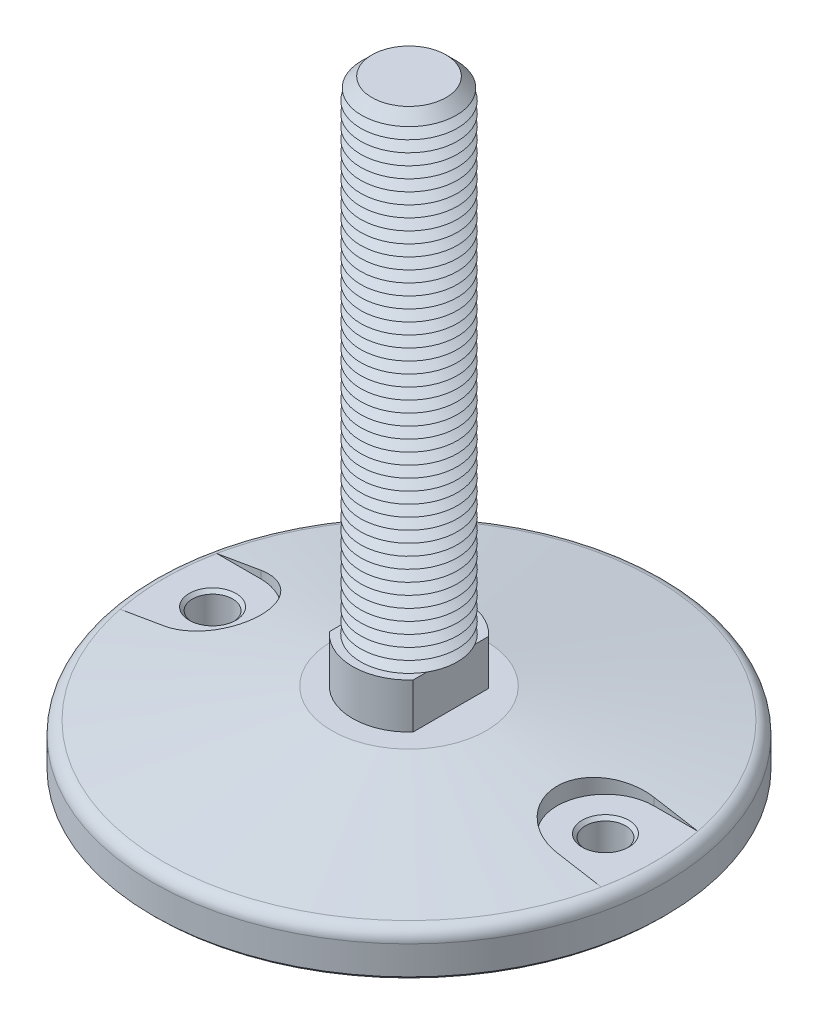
ISO-10303-21;
HEADER;
FILE_DESCRIPTION(('STEP AP214'),'2;1');
FILE_NAME('part.step','',(''),(''),'','','');
FILE_SCHEMA(('AUTOMOTIVE_DESIGN { 1 0 10303 214 1 1 1 1 }'));
ENDSEC;
DATA;
#1=APPLICATION_CONTEXT('core data for automotive mechanical design processes');
#2=APPLICATION_PROTOCOL_DEFINITION('international standard','automotive_design',2000,#1);
#3=PRODUCT_CONTEXT('',#1,'mechanical');
#4=PRODUCT('Part','Part','',(#3));
#5=PRODUCT_RELATED_PRODUCT_CATEGORY('part','',(#4));
#6=PRODUCT_DEFINITION_FORMATION('','',#4);
#7=PRODUCT_DEFINITION_CONTEXT('part definition',#1,'design');
#8=PRODUCT_DEFINITION('design','',#6,#7);
#9=PRODUCT_DEFINITION_SHAPE('','',#8);
#10=(LENGTH_UNIT() NAMED_UNIT(*) SI_UNIT(.MILLI.,.METRE.));
#11=(NAMED_UNIT(*) PLANE_ANGLE_UNIT() SI_UNIT($,.RADIAN.));
#12=(NAMED_UNIT(*) SI_UNIT($,.STERADIAN.) SOLID_ANGLE_UNIT());
#13=UNCERTAINTY_MEASURE_WITH_UNIT(LENGTH_MEASURE(1.E-05),#10,'distance_accuracy_value','');
#14=(GEOMETRIC_REPRESENTATION_CONTEXT(3) GLOBAL_UNCERTAINTY_ASSIGNED_CONTEXT((#13)) GLOBAL_UNIT_ASSIGNED_CONTEXT((#10,
#11,#12)) REPRESENTATION_CONTEXT('',''));
#15=CARTESIAN_POINT('',(0.,0.,0.));
#16=DIRECTION('',(0.,0.,1.));
#17=DIRECTION('',(1.,0.,0.));
#18=AXIS2_PLACEMENT_3D('',#15,#16,#17);
#19=CARTESIAN_POINT('',(0.,0.,0.));
#20=DIRECTION('',(0.,-1.,0.));
#21=DIRECTION('',(0.,0.,-1.));
#22=AXIS2_PLACEMENT_3D('',#19,#20,#21);
#23=CONICAL_SURFACE('',#22,24.,1.39626340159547);
#24=CARTESIAN_POINT('',(-61.0002,-6.84455305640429,14.9999999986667));
#25=CARTESIAN_POINT('',(-60.5719080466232,-6.77122530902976,15.0000486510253));
#26=CARTESIAN_POINT('',(-60.1437494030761,-6.69717888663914,14.981669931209));
#27=CARTESIAN_POINT('',(-59.2907529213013,-6.54813452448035,14.9084324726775));
#28=CARTESIAN_POINT('',(-58.865914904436,-6.47313663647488,14.8535757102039));
#29=CARTESIAN_POINT('',(-58.0227762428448,-6.32270449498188,14.7077930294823));
#30=CARTESIAN_POINT('',(-57.6044724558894,-6.24727047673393,14.6168850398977));
#31=CARTESIAN_POINT('',(-56.7771541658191,-6.09645264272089,14.3996686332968));
#32=CARTESIAN_POINT('',(-56.3681395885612,-6.02106882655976,14.2733604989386));
#33=CARTESIAN_POINT('',(-55.5621199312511,-5.87087312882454,13.986156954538));
#34=CARTESIAN_POINT('',(-55.1651202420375,-5.79606151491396,13.8252462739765));
#35=CARTESIAN_POINT('',(-54.3861487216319,-5.64763733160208,13.4699748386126));
#36=CARTESIAN_POINT('',(-54.0041768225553,-5.57402475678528,13.2756142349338));
#37=CARTESIAN_POINT('',(-53.2580678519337,-5.42864124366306,12.8548003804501));
#38=CARTESIAN_POINT('',(-52.8939274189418,-5.35686995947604,12.6283532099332));
#39=CARTESIAN_POINT('',(-52.186041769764,-5.21581901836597,12.1448693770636));
#40=CARTESIAN_POINT('',(-51.8422964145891,-5.14653934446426,11.8878329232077));
#41=CARTESIAN_POINT('',(-51.1785561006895,-5.01133737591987,11.3455904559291));
#42=CARTESIAN_POINT('',(-50.8585036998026,-4.94540709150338,11.0604567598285));
#43=CARTESIAN_POINT('',(-50.2435776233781,-4.81743482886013,10.463413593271));
#44=CARTESIAN_POINT('',(-49.948704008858,-4.75539286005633,10.1515040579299));
#45=CARTESIAN_POINT('',(-49.3863482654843,-4.6359259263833,9.5030156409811));
#46=CARTESIAN_POINT('',(-49.1188689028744,-4.57850142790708,9.16643427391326));
#47=CARTESIAN_POINT('',(-48.6134211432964,-4.46901587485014,8.47097635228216));
#48=CARTESIAN_POINT('',(-48.3754523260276,-4.41695474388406,8.11210011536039));
#49=CARTESIAN_POINT('',(-47.9343068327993,-4.31966643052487,7.38020662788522));
#50=CARTESIAN_POINT('',(-47.7306564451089,-4.27434742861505,7.00748710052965));
#51=CARTESIAN_POINT('',(-47.3554457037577,-4.19027418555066,6.24551642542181));
#52=CARTESIAN_POINT('',(-47.1838850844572,-4.15151989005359,5.85626541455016));
#53=CARTESIAN_POINT('',(-46.8742907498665,-4.08118572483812,5.06410373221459));
#54=CARTESIAN_POINT('',(-46.7362508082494,-4.04960452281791,4.66119561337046));
#55=CARTESIAN_POINT('',(-46.4948208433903,-3.99412823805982,3.84461191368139));
#56=CARTESIAN_POINT('',(-46.3914302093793,-3.97023301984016,3.43093652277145));
#57=CARTESIAN_POINT('',(-46.2221429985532,-3.93099396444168,2.60545435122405));
#58=CARTESIAN_POINT('',(-46.1554440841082,-3.91546729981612,2.19382064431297));
#59=CARTESIAN_POINT('',(-46.0565351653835,-3.8924103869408,1.36621022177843));
#60=CARTESIAN_POINT('',(-46.0243246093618,-3.88488001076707,0.95023357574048));
#61=CARTESIAN_POINT('',(-45.9946646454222,-3.87794669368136,0.117003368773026));
#62=CARTESIAN_POINT('',(-45.9972129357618,-3.87854321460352,-0.300250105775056));
#63=CARTESIAN_POINT('',(-46.0370435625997,-3.88785198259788,-1.13300367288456));
#64=CARTESIAN_POINT('',(-46.0743257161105,-3.89656418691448,-1.54850377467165));
#65=CARTESIAN_POINT('',(-46.182543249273,-3.92177454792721,-2.36891759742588));
#66=CARTESIAN_POINT('',(-46.2529993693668,-3.93816180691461,-2.77389806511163));
#67=CARTESIAN_POINT('',(-46.4267978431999,-3.97840764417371,-3.57635456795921));
#68=CARTESIAN_POINT('',(-46.5301398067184,-4.00226613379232,-3.97383069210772));
#69=CARTESIAN_POINT('',(-46.7688882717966,-4.05707448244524,-4.75853501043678));
#70=CARTESIAN_POINT('',(-46.9042953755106,-4.08802447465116,-5.14576301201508));
#71=CARTESIAN_POINT('',(-47.206117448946,-4.15654424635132,-5.90733280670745));
#72=CARTESIAN_POINT('',(-47.3725327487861,-4.19411409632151,-6.28167446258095));
#73=CARTESIAN_POINT('',(-47.7365717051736,-4.27566086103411,-7.01794010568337));
#74=CARTESIAN_POINT('',(-47.9344367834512,-4.31968711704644,-7.37973923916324));
#75=CARTESIAN_POINT('',(-48.3589021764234,-4.41331257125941,-8.08530451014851));
#76=CARTESIAN_POINT('',(-48.5855025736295,-4.46291178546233,-8.42907059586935));
#77=CARTESIAN_POINT('',(-49.0657858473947,-4.56705084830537,-9.09634650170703));
#78=CARTESIAN_POINT('',(-49.3194694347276,-4.62159082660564,-9.41985578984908));
#79=CARTESIAN_POINT('',(-49.8521052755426,-4.73496487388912,-10.0445475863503));
#80=CARTESIAN_POINT('',(-50.131057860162,-4.79379899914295,-10.3457298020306));
#81=CARTESIAN_POINT('',(-50.7186282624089,-4.91644106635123,-10.9301791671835));
#82=CARTESIAN_POINT('',(-51.0277601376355,-4.98032946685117,-11.2129127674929));
#83=CARTESIAN_POINT('',(-51.6681809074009,-5.11124627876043,-11.7512616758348));
#84=CARTESIAN_POINT('',(-51.9994702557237,-5.17827475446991,-12.0068764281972));
#85=CARTESIAN_POINT('',(-52.6820261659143,-5.31484958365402,-12.489438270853));
#86=CARTESIAN_POINT('',(-53.0333008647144,-5.38439695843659,-12.7163735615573));
#87=CARTESIAN_POINT('',(-53.7532696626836,-5.52535961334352,-13.1399905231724));
#88=CARTESIAN_POINT('',(-54.1219634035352,-5.59677485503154,-13.3366728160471));
#89=CARTESIAN_POINT('',(-54.8815627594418,-5.74228287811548,-13.7020352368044));
#90=CARTESIAN_POINT('',(-55.2727604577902,-5.81640072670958,-13.8700983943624));
#91=CARTESIAN_POINT('',(-56.0678984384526,-5.96537527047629,-14.1723417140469));
#92=CARTESIAN_POINT('',(-56.4718387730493,-6.04023196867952,-14.3065217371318));
#93=CARTESIAN_POINT('',(-57.2891056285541,-6.19003340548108,-14.5399332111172));
#94=CARTESIAN_POINT('',(-57.7024198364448,-6.26497791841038,-14.6392079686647));
#95=CARTESIAN_POINT('',(-58.5358762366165,-6.4145012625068,-14.8023063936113));
#96=CARTESIAN_POINT('',(-58.9560150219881,-6.48908025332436,-14.8661472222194));
#97=CARTESIAN_POINT('',(-59.6475646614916,-6.61057728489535,-14.9413662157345));
#98=CARTESIAN_POINT('',(-59.9178207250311,-6.65774602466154,-14.9633673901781));
#99=CARTESIAN_POINT('',(-60.458759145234,-6.75155340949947,-14.9926755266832));
#100=CARTESIAN_POINT('',(-60.7294400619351,-6.79819280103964,-15.000006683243));
#101=CARTESIAN_POINT('',(-61.0002,-6.84455305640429,-14.9999999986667));
#102=B_SPLINE_CURVE_WITH_KNOTS('',3,(#24,#25,#26,#27,#28,#29,#30,#31,#32,#33,#34,#35,#36,#37,
#38,#39,#40,#41,#42,#43,#44,#45,#46,#47,#48,#49,#50,#51,#52,#53,#54,#55,#56,#57,#58,#59,#60,#61,
#62,#63,#64,#65,#66,#67,#68,#69,#70,#71,#72,#73,#74,#75,#76,#77,#78,#79,#80,#81,#82,#83,#84,#85,
#86,#87,#88,#89,#90,#91,#92,#93,#94,#95,#96,#97,#98,#99,#100,#101),.UNSPECIFIED.,.F.,.F.,(4,2,2,
2,2,2,2,2,2,2,2,2,2,2,2,2,2,2,2,2,2,2,2,2,2,2,2,2,2,2,2,2,2,2,2,2,2,2,4),(0.,1.30316757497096,
2.6062645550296,3.9087143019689,5.21115364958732,6.51416896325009,7.81717839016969,
9.11994123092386,10.4226951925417,11.722179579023,13.0216671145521,14.3212857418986,
15.620885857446,16.9007390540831,18.1805816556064,19.4601863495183,20.7397684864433,
21.9901285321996,23.2404685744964,24.4907258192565,25.7409764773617,26.9736945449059,
28.2063979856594,29.4391245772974,30.67186429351,31.9145698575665,33.1572789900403,
34.4000207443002,35.6427787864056,36.912623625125,38.1824944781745,39.4528861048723,
40.7232516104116,42.0182516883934,43.3132570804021,44.6066500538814,45.8994160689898,
46.7247199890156,47.5486616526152),.UNSPECIFIED.);
#103=CARTESIAN_POINT('',(-61.,-6.84451881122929,15.));
#104=VERTEX_POINT('',#103);
#105=CARTESIAN_POINT('',(-61.,-6.84451881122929,-15.));
#106=VERTEX_POINT('',#105);
#107=EDGE_CURVE('E614',#104,#106,#102,.T.);
#108=ORIENTED_EDGE('',*,*,#107,.F.);
#109=CARTESIAN_POINT('',(-104.042185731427,-14.3032773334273,15.));
#110=CARTESIAN_POINT('',(-101.426826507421,-13.8468501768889,15.));
#111=CARTESIAN_POINT('',(-98.8114117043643,-13.3907410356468,15.));
#112=CARTESIAN_POINT('',(-93.5804323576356,-12.4793845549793,15.));
#113=CARTESIAN_POINT('',(-90.964867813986,-12.0241372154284,15.));
#114=CARTESIAN_POINT('',(-85.7335581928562,-11.1147314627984,15.));
#115=CARTESIAN_POINT('',(-83.1178131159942,-10.6605730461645,15.));
#116=CARTESIAN_POINT('',(-77.8860747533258,-9.75368383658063,15.));
#117=CARTESIAN_POINT('',(-75.2700814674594,-9.30095304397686,15.));
#118=CARTESIAN_POINT('',(-70.0377535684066,-8.39740791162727,15.));
#119=CARTESIAN_POINT('',(-67.4214189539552,-7.94659357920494,15.));
#120=CARTESIAN_POINT('',(-62.1882957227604,-7.04761438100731,15.));
#121=CARTESIAN_POINT('',(-59.5715071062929,-6.59944951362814,15.));
#122=CARTESIAN_POINT('',(-55.6458288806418,-5.93007736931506,15.));
#123=CARTESIAN_POINT('',(-54.3371844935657,-5.70743210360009,15.));
#124=CARTESIAN_POINT('',(-51.7196954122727,-5.26332337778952,15.));
#125=CARTESIAN_POINT('',(-50.4108507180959,-5.04185991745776,15.));
#126=CARTESIAN_POINT('',(-47.7929137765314,-4.60038366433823,15.));
#127=CARTESIAN_POINT('',(-46.4838215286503,-4.38037087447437,15.));
#128=CARTESIAN_POINT('',(-43.8653264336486,-3.94219643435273,15.));
#129=CARTESIAN_POINT('',(-42.5559235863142,-3.72403478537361,15.));
#130=CARTESIAN_POINT('',(-41.2463335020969,-3.50699886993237,15.));
#131=B_SPLINE_CURVE_WITH_KNOTS('',3,(#109,#110,#111,#112,#113,#114,#115,#116,#117,#118,#119,
#120,#121,#122,#123,#124,#125,#126,#127,#128,#129,#130),.UNSPECIFIED.,.F.,.F.,(4,2,2,2,2,2,2,2,
2,2,4),(0.,7.96466371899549,15.9293262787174,23.8939628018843,31.8586012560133,39.8232701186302,
47.7879341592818,51.7702809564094,55.7526269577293,59.734980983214,63.7173377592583),.UNSPECIFIED.);
#132=CARTESIAN_POINT('',(-74.6843450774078,-9.2,15.));
#133=VERTEX_POINT('',#132);
#134=EDGE_CURVE('E588',#133,#104,#131,.T.);
#135=ORIENTED_EDGE('',*,*,#134,.F.);
#136=CARTESIAN_POINT('',(0.,-9.2,0.));
#137=DIRECTION('',(0.,1.,0.));
#138=DIRECTION('',(0.,0.,1.));
#139=AXIS2_PLACEMENT_3D('',#136,#137,#138);
#140=CIRCLE('',#139,76.175792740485);
#141=CARTESIAN_POINT('',(-74.6843450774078,-9.2,-15.));
#142=VERTEX_POINT('',#141);
#143=EDGE_CURVE('E573',#133,#142,#140,.F.);
#144=ORIENTED_EDGE('',*,*,#143,.T.);
#145=CARTESIAN_POINT('',(-41.2463335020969,-3.50699886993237,-15.));
#146=CARTESIAN_POINT('',(-42.5559235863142,-3.72403478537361,-15.));
#147=CARTESIAN_POINT('',(-43.8653264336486,-3.94219643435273,-15.));
#148=CARTESIAN_POINT('',(-46.4838215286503,-4.38037087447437,-15.));
#149=CARTESIAN_POINT('',(-47.7929137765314,-4.60038366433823,-15.));
#150=CARTESIAN_POINT('',(-50.4108507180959,-5.04185991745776,-15.));
#151=CARTESIAN_POINT('',(-51.7196954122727,-5.26332337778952,-15.));
#152=CARTESIAN_POINT('',(-54.3371844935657,-5.70743210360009,-15.));
#153=CARTESIAN_POINT('',(-55.6458288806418,-5.93007736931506,-15.));
#154=CARTESIAN_POINT('',(-59.5715071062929,-6.59944951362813,-15.));
#155=CARTESIAN_POINT('',(-62.1882957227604,-7.04761438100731,-15.));
#156=CARTESIAN_POINT('',(-67.4214189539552,-7.94659357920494,-15.));
#157=CARTESIAN_POINT('',(-70.0377535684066,-8.39740791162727,-15.));
#158=CARTESIAN_POINT('',(-75.2700814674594,-9.30095304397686,-15.));
#159=CARTESIAN_POINT('',(-77.8860747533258,-9.75368383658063,-15.));
#160=CARTESIAN_POINT('',(-83.1178131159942,-10.6605730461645,-15.));
#161=CARTESIAN_POINT('',(-85.7335581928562,-11.1147314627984,-15.));
#162=CARTESIAN_POINT('',(-90.964867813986,-12.0241372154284,-15.));
#163=CARTESIAN_POINT('',(-93.5804323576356,-12.4793845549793,-15.));
#164=CARTESIAN_POINT('',(-98.8114117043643,-13.3907410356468,-15.));
#165=CARTESIAN_POINT('',(-101.426826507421,-13.8468501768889,-15.));
#166=CARTESIAN_POINT('',(-104.042185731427,-14.3032773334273,-15.));
#167=B_SPLINE_CURVE_WITH_KNOTS('',3,(#145,#146,#147,#148,#149,#150,#151,#152,#153,#154,#155,
#156,#157,#158,#159,#160,#161,#162,#163,#164,#165,#166),.UNSPECIFIED.,.F.,.F.,(4,2,2,2,2,2,2,2,
2,2,4),(0.,3.98235677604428,7.96471080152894,11.9470568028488,15.9294035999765,23.8940676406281,
31.8587365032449,39.8233749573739,47.7880114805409,55.7526740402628,63.7173377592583),.UNSPECIFIED.);
#168=EDGE_CURVE('E580',#106,#142,#167,.T.);
#169=ORIENTED_EDGE('',*,*,#168,.F.);
#170=EDGE_LOOP('',(#108,#135,#144,#169));
#171=FACE_BOUND('',#170,.T.);
#172=CARTESIAN_POINT('',(0.,-9.20331494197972,0.));
#173=DIRECTION('',(0.,1.,0.));
#174=DIRECTION('',(0.,0.,1.));
#175=AXIS2_PLACEMENT_3D('',#172,#173,#174);
#176=CIRCLE('',#175,76.1945927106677);
#177=CARTESIAN_POINT('',(0.,-9.20331494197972,76.1945927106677));
#178=VERTEX_POINT('',#177);
#179=EDGE_CURVE('E562',#178,#178,#176,.T.);
#180=ORIENTED_EDGE('',*,*,#179,.T.);
#181=EDGE_LOOP('',(#180));
#182=FACE_BOUND('',#181,.T.);
#183=CARTESIAN_POINT('',(0.,0.,0.));
#184=DIRECTION('',(0.,1.,0.));
#185=DIRECTION('',(0.,0.,1.));
#186=AXIS2_PLACEMENT_3D('',#183,#184,#185);
#187=CIRCLE('',#186,24.);
#188=CARTESIAN_POINT('',(0.,0.,24.));
#189=VERTEX_POINT('',#188);
#190=EDGE_CURVE('E558',#189,#189,#187,.T.);
#191=ORIENTED_EDGE('',*,*,#190,.F.);
#192=EDGE_LOOP('',(#191));
#193=FACE_BOUND('',#192,.T.);
#194=CARTESIAN_POINT('',(94.0652754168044,-12.563957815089,15.));
#195=CARTESIAN_POINT('',(91.449731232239,-12.1085412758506,15.));
#196=CARTESIAN_POINT('',(88.8341137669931,-11.653544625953,15.));
#197=CARTESIAN_POINT('',(83.6026721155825,-10.7447399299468,15.));
#198=CARTESIAN_POINT('',(80.9868479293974,-10.2909318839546,15.));
#199=CARTESIAN_POINT('',(75.7549567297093,-9.38485738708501,15.));
#200=CARTESIAN_POINT('',(73.1388897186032,-8.93259092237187,15.));
#201=CARTESIAN_POINT('',(67.9063931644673,-8.03014521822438,15.));
#202=CARTESIAN_POINT('',(65.2899636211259,-7.57996598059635,15.));
#203=CARTESIAN_POINT('',(60.0565735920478,-6.68252310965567,15.));
#204=CARTESIAN_POINT('',(57.4396131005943,-6.2352595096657,15.));
#205=CARTESIAN_POINT('',(52.2049769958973,-5.34496105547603,15.));
#206=CARTESIAN_POINT('',(49.5873013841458,-4.90192619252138,15.));
#207=CARTESIAN_POINT('',(45.659951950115,-4.24226428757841,15.));
#208=CARTESIAN_POINT('',(44.3506891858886,-4.02319090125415,15.));
#209=CARTESIAN_POINT('',(41.7318168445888,-3.58713211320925,15.));
#210=CARTESIAN_POINT('',(40.4222072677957,-3.3701467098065,15.));
#211=CARTESIAN_POINT('',(37.8025367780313,-2.93885600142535,15.));
#212=CARTESIAN_POINT('',(36.4924758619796,-2.72455071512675,15.));
#213=CARTESIAN_POINT('',(34.5269525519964,-2.40574421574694,15.));
#214=CARTESIAN_POINT('',(33.8717052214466,-2.29991714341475,15.));
#215=CARTESIAN_POINT('',(32.5610443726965,-2.08929455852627,15.));
#216=CARTESIAN_POINT('',(31.9056308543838,-1.98449904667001,15.));
#217=CARTESIAN_POINT('',(31.2501232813,-1.88029321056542,15.));
#218=B_SPLINE_CURVE_WITH_KNOTS('',3,(#194,#195,#196,#197,#198,#199,#200,#201,#202,#203,#204,
#205,#206,#207,#208,#209,#210,#211,#212,#213,#214,#215,#216,#217),.UNSPECIFIED.,.F.,.F.,(4,2,2,
2,2,2,2,2,2,2,2,4),(0.,7.96468982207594,15.9293804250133,23.8939993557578,31.8586251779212,
39.82334186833,47.7880420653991,51.7704344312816,55.7528235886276,59.7352404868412,
61.7264544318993,63.7176697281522),.UNSPECIFIED.);
#219=CARTESIAN_POINT('',(74.6843450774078,-9.2,15.));
#220=VERTEX_POINT('',#219);
#221=CARTESIAN_POINT('',(61.,-6.84451881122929,15.));
#222=VERTEX_POINT('',#221);
#223=EDGE_CURVE('E133',#220,#222,#218,.T.);
#224=ORIENTED_EDGE('',*,*,#223,.T.);
#225=CARTESIAN_POINT('',(61.0002,-6.84455305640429,14.9999999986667));
#226=CARTESIAN_POINT('',(60.5719080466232,-6.77122530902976,15.0000486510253));
#227=CARTESIAN_POINT('',(60.1437494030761,-6.69717888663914,14.981669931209));
#228=CARTESIAN_POINT('',(59.2907529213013,-6.54813452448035,14.9084324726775));
#229=CARTESIAN_POINT('',(58.865914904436,-6.47313663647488,14.8535757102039));
#230=CARTESIAN_POINT('',(58.0227762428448,-6.32270449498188,14.7077930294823));
#231=CARTESIAN_POINT('',(57.6044724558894,-6.24727047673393,14.6168850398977));
#232=CARTESIAN_POINT('',(56.7771541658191,-6.09645264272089,14.3996686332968));
#233=CARTESIAN_POINT('',(56.3681395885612,-6.02106882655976,14.2733604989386));
#234=CARTESIAN_POINT('',(55.5621199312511,-5.87087312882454,13.986156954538));
#235=CARTESIAN_POINT('',(55.1651202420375,-5.79606151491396,13.8252462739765));
#236=CARTESIAN_POINT('',(54.3861487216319,-5.64763733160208,13.4699748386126));
#237=CARTESIAN_POINT('',(54.0041768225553,-5.57402475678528,13.2756142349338));
#238=CARTESIAN_POINT('',(53.2580678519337,-5.42864124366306,12.8548003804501));
#239=CARTESIAN_POINT('',(52.8939274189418,-5.35686995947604,12.6283532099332));
#240=CARTESIAN_POINT('',(52.186041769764,-5.21581901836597,12.1448693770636));
#241=CARTESIAN_POINT('',(51.8422964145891,-5.14653934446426,11.8878329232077));
#242=CARTESIAN_POINT('',(51.1785561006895,-5.01133737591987,11.3455904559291));
#243=CARTESIAN_POINT('',(50.8585036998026,-4.94540709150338,11.0604567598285));
#244=CARTESIAN_POINT('',(50.2435776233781,-4.81743482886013,10.463413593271));
#245=CARTESIAN_POINT('',(49.948704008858,-4.75539286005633,10.1515040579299));
#246=CARTESIAN_POINT('',(49.3863482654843,-4.6359259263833,9.5030156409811));
#247=CARTESIAN_POINT('',(49.1188689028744,-4.57850142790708,9.16643427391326));
#248=CARTESIAN_POINT('',(48.6134211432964,-4.46901587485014,8.47097635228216));
#249=CARTESIAN_POINT('',(48.3754523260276,-4.41695474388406,8.11210011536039));
#250=CARTESIAN_POINT('',(47.9343068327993,-4.31966643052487,7.38020662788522));
#251=CARTESIAN_POINT('',(47.7306564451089,-4.27434742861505,7.00748710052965));
#252=CARTESIAN_POINT('',(47.3554457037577,-4.19027418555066,6.24551642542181));
#253=CARTESIAN_POINT('',(47.1838850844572,-4.15151989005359,5.85626541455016));
#254=CARTESIAN_POINT('',(46.8742907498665,-4.08118572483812,5.06410373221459));
#255=CARTESIAN_POINT('',(46.7362508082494,-4.04960452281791,4.66119561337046));
#256=CARTESIAN_POINT('',(46.4948208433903,-3.99412823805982,3.84461191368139));
#257=CARTESIAN_POINT('',(46.3914302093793,-3.97023301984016,3.43093652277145));
#258=CARTESIAN_POINT('',(46.2221429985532,-3.93099396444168,2.60545435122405));
#259=CARTESIAN_POINT('',(46.1554440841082,-3.91546729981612,2.19382064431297));
#260=CARTESIAN_POINT('',(46.0565351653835,-3.8924103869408,1.36621022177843));
#261=CARTESIAN_POINT('',(46.0243246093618,-3.88488001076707,0.95023357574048));
#262=CARTESIAN_POINT('',(45.9946646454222,-3.87794669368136,0.117003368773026));
#263=CARTESIAN_POINT('',(45.9972129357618,-3.87854321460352,-0.300250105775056));
#264=CARTESIAN_POINT('',(46.0370435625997,-3.88785198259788,-1.13300367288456));
#265=CARTESIAN_POINT('',(46.0743257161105,-3.89656418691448,-1.54850377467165));
#266=CARTESIAN_POINT('',(46.182543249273,-3.92177454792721,-2.36891759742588));
#267=CARTESIAN_POINT('',(46.2529993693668,-3.93816180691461,-2.77389806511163));
#268=CARTESIAN_POINT('',(46.4267978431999,-3.97840764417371,-3.57635456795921));
#269=CARTESIAN_POINT('',(46.5301398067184,-4.00226613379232,-3.97383069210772));
#270=CARTESIAN_POINT('',(46.7688882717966,-4.05707448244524,-4.75853501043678));
#271=CARTESIAN_POINT('',(46.9042953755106,-4.08802447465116,-5.14576301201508));
#272=CARTESIAN_POINT('',(47.206117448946,-4.15654424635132,-5.90733280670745));
#273=CARTESIAN_POINT('',(47.3725327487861,-4.19411409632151,-6.28167446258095));
#274=CARTESIAN_POINT('',(47.7365717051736,-4.27566086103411,-7.01794010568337));
#275=CARTESIAN_POINT('',(47.9344367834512,-4.31968711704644,-7.37973923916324));
#276=CARTESIAN_POINT('',(48.3589021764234,-4.41331257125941,-8.08530451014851));
#277=CARTESIAN_POINT('',(48.5855025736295,-4.46291178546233,-8.42907059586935));
#278=CARTESIAN_POINT('',(49.0657858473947,-4.56705084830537,-9.09634650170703));
#279=CARTESIAN_POINT('',(49.3194694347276,-4.62159082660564,-9.41985578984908));
#280=CARTESIAN_POINT('',(49.8521052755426,-4.73496487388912,-10.0445475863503));
#281=CARTESIAN_POINT('',(50.131057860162,-4.79379899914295,-10.3457298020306));
#282=CARTESIAN_POINT('',(50.7186282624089,-4.91644106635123,-10.9301791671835));
#283=CARTESIAN_POINT('',(51.0277601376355,-4.98032946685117,-11.2129127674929));
#284=CARTESIAN_POINT('',(51.6681809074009,-5.11124627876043,-11.7512616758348));
#285=CARTESIAN_POINT('',(51.9994702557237,-5.17827475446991,-12.0068764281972));
#286=CARTESIAN_POINT('',(52.6820261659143,-5.31484958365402,-12.489438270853));
#287=CARTESIAN_POINT('',(53.0333008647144,-5.38439695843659,-12.7163735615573));
#288=CARTESIAN_POINT('',(53.7532696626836,-5.52535961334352,-13.1399905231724));
#289=CARTESIAN_POINT('',(54.1219634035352,-5.59677485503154,-13.3366728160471));
#290=CARTESIAN_POINT('',(54.8815627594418,-5.74228287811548,-13.7020352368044));
#291=CARTESIAN_POINT('',(55.2727604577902,-5.81640072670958,-13.8700983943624));
#292=CARTESIAN_POINT('',(56.0678984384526,-5.96537527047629,-14.1723417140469));
#293=CARTESIAN_POINT('',(56.4718387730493,-6.04023196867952,-14.3065217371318));
#294=CARTESIAN_POINT('',(57.2891056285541,-6.19003340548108,-14.5399332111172));
#295=CARTESIAN_POINT('',(57.7024198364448,-6.26497791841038,-14.6392079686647));
#296=CARTESIAN_POINT('',(58.5358762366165,-6.4145012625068,-14.8023063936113));
#297=CARTESIAN_POINT('',(58.9560150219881,-6.48908025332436,-14.8661472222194));
#298=CARTESIAN_POINT('',(59.6475646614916,-6.61057728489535,-14.9413662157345));
#299=CARTESIAN_POINT('',(59.9178207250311,-6.65774602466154,-14.9633673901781));
#300=CARTESIAN_POINT('',(60.458759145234,-6.75155340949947,-14.9926755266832));
#301=CARTESIAN_POINT('',(60.7294400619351,-6.79819280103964,-15.000006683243));
#302=CARTESIAN_POINT('',(61.0002,-6.84455305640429,-14.9999999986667));
#303=B_SPLINE_CURVE_WITH_KNOTS('',3,(#225,#226,#227,#228,#229,#230,#231,#232,#233,#234,#235,
#236,#237,#238,#239,#240,#241,#242,#243,#244,#245,#246,#247,#248,#249,#250,#251,#252,#253,#254,
#255,#256,#257,#258,#259,#260,#261,#262,#263,#264,#265,#266,#267,#268,#269,#270,#271,#272,#273,
#274,#275,#276,#277,#278,#279,#280,#281,#282,#283,#284,#285,#286,#287,#288,#289,#290,#291,#292,
#293,#294,#295,#296,#297,#298,#299,#300,#301,#302),.UNSPECIFIED.,.F.,.F.,(4,2,2,2,2,2,2,2,2,2,2,
2,2,2,2,2,2,2,2,2,2,2,2,2,2,2,2,2,2,2,2,2,2,2,2,2,2,2,4),(0.,1.30316757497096,2.6062645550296,
3.9087143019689,5.21115364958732,6.51416896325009,7.81717839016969,9.11994123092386,
10.4226951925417,11.722179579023,13.0216671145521,14.3212857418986,15.620885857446,
16.9007390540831,18.1805816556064,19.4601863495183,20.7397684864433,21.9901285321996,
23.2404685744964,24.4907258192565,25.7409764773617,26.9736945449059,28.2063979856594,
29.4391245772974,30.67186429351,31.9145698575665,33.1572789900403,34.4000207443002,
35.6427787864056,36.912623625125,38.1824944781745,39.4528861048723,40.7232516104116,
42.0182516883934,43.3132570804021,44.6066500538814,45.8994160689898,46.7247199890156,
47.5486616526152),.UNSPECIFIED.);
#304=CARTESIAN_POINT('',(61.,-6.84451881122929,-15.));
#305=VERTEX_POINT('',#304);
#306=EDGE_CURVE('E145',#222,#305,#303,.T.);
#307=ORIENTED_EDGE('',*,*,#306,.T.);
#308=CARTESIAN_POINT('',(31.2501232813,-1.88029321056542,-15.));
#309=CARTESIAN_POINT('',(31.9056308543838,-1.98449904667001,-15.));
#310=CARTESIAN_POINT('',(32.5610443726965,-2.08929455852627,-15.));
#311=CARTESIAN_POINT('',(33.8717052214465,-2.29991714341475,-15.));
#312=CARTESIAN_POINT('',(34.5269525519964,-2.40574421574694,-15.));
#313=CARTESIAN_POINT('',(36.4924758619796,-2.72455071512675,-15.));
#314=CARTESIAN_POINT('',(37.8025367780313,-2.93885600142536,-15.));
#315=CARTESIAN_POINT('',(40.4222072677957,-3.3701467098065,-15.));
#316=CARTESIAN_POINT('',(41.7318168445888,-3.58713211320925,-15.));
#317=CARTESIAN_POINT('',(44.3506891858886,-4.02319090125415,-15.));
#318=CARTESIAN_POINT('',(45.659951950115,-4.24226428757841,-15.));
#319=CARTESIAN_POINT('',(49.5873013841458,-4.90192619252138,-15.));
#320=CARTESIAN_POINT('',(52.2049769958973,-5.34496105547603,-15.));
#321=CARTESIAN_POINT('',(57.4396131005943,-6.2352595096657,-15.));
#322=CARTESIAN_POINT('',(60.0565735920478,-6.68252310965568,-15.));
#323=CARTESIAN_POINT('',(65.2899636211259,-7.57996598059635,-15.));
#324=CARTESIAN_POINT('',(67.9063931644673,-8.03014521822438,-15.));
#325=CARTESIAN_POINT('',(73.1388897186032,-8.93259092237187,-15.));
#326=CARTESIAN_POINT('',(75.7549567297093,-9.38485738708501,-15.));
#327=CARTESIAN_POINT('',(80.9868479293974,-10.2909318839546,-15.));
#328=CARTESIAN_POINT('',(83.6026721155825,-10.7447399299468,-15.));
#329=CARTESIAN_POINT('',(88.8341137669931,-11.653544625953,-15.));
#330=CARTESIAN_POINT('',(91.449731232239,-12.1085412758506,-15.));
#331=CARTESIAN_POINT('',(94.0652754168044,-12.563957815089,-15.));
#332=B_SPLINE_CURVE_WITH_KNOTS('',3,(#308,#309,#310,#311,#312,#313,#314,#315,#316,#317,#318,
#319,#320,#321,#322,#323,#324,#325,#326,#327,#328,#329,#330,#331),.UNSPECIFIED.,.F.,.F.,(4,2,2,
2,2,2,2,2,2,2,2,4),(0.,1.99121529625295,3.98242924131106,7.96484613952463,11.9472352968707,
15.9296276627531,23.8943278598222,31.859044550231,39.8236703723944,47.7882893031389,
55.7529799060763,63.7176697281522),.UNSPECIFIED.);
#333=CARTESIAN_POINT('',(74.6843450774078,-9.2,-15.));
#334=VERTEX_POINT('',#333);
#335=EDGE_CURVE('E645',#305,#334,#332,.T.);
#336=ORIENTED_EDGE('',*,*,#335,.T.);
#337=CARTESIAN_POINT('',(0.,-9.2,0.));
#338=DIRECTION('',(0.,1.,0.));
#339=DIRECTION('',(0.,0.,1.));
#340=AXIS2_PLACEMENT_3D('',#337,#338,#339);
#341=CIRCLE('',#340,76.175792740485);
#342=EDGE_CURVE('E636',#334,#220,#341,.F.);
#343=ORIENTED_EDGE('',*,*,#342,.T.);
#344=EDGE_LOOP('',(#224,#307,#336,#343));
#345=FACE_BOUND('',#344,.T.);
#346=ADVANCED_FACE('F39',(#171,#182,#193,#345),#23,.T.);
#347=CARTESIAN_POINT('',(0.,14.,0.));
#348=DIRECTION('',(0.,1.,0.));
#349=DIRECTION('',(0.,0.,1.));
#350=AXIS2_PLACEMENT_3D('',#347,#348,#349);
#351=PLANE('',#350);
#352=CARTESIAN_POINT('',(0.,14.,0.));
#353=DIRECTION('',(0.,1.,0.));
#354=DIRECTION('',(0.,0.,1.));
#355=AXIS2_PLACEMENT_3D('',#352,#353,#354);
#356=CIRCLE('',#355,15.);
#357=CARTESIAN_POINT('',(13.,14.,-7.48331477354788));
#358=VERTEX_POINT('',#357);
#359=CARTESIAN_POINT('',(-13.,14.,-7.48331477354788));
#360=VERTEX_POINT('',#359);
#361=EDGE_CURVE('E574',#358,#360,#356,.T.);
#362=ORIENTED_EDGE('',*,*,#361,.F.);
#363=DIRECTION('',(0.,0.,1.));
#364=VECTOR('',#363,1.);
#365=CARTESIAN_POINT('',(13.,14.,11.71537451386));
#366=LINE('',#365,#364);
#367=CARTESIAN_POINT('',(13.,14.,-11.71537451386));
#368=VERTEX_POINT('',#367);
#369=EDGE_CURVE('E538',#368,#358,#366,.T.);
#370=ORIENTED_EDGE('',*,*,#369,.F.);
#371=CARTESIAN_POINT('',(0.,14.,0.));
#372=DIRECTION('',(0.,1.,0.));
#373=DIRECTION('',(0.,0.,1.));
#374=AXIS2_PLACEMENT_3D('',#371,#372,#373);
#375=CIRCLE('',#374,17.5);
#376=CARTESIAN_POINT('',(-13.,14.,-11.71537451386));
#377=VERTEX_POINT('',#376);
#378=EDGE_CURVE('E551',#368,#377,#375,.T.);
#379=ORIENTED_EDGE('',*,*,#378,.T.);
#380=DIRECTION('',(0.,0.,-1.));
#381=VECTOR('',#380,1.);
#382=CARTESIAN_POINT('',(-13.,14.,-11.71537451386));
#383=LINE('',#382,#381);
#384=EDGE_CURVE('E525',#360,#377,#383,.T.);
#385=ORIENTED_EDGE('',*,*,#384,.F.);
#386=EDGE_LOOP('',(#362,#370,#379,#385));
#387=FACE_BOUND('',#386,.T.);
#388=ADVANCED_FACE('F699',(#387),#351,.T.);
#389=CARTESIAN_POINT('',(0.,14.,0.));
#390=DIRECTION('',(0.,-1.,0.));
#391=DIRECTION('',(0.,0.,-1.));
#392=AXIS2_PLACEMENT_3D('',#389,#390,#391);
#393=CYLINDRICAL_SURFACE('',#392,17.5);
#394=CARTESIAN_POINT('',(-13.,14.,11.71537451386));
#395=VERTEX_POINT('',#394);
#396=CARTESIAN_POINT('',(13.,14.,11.71537451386));
#397=VERTEX_POINT('',#396);
#398=EDGE_CURVE('E530',#395,#397,#375,.T.);
#399=ORIENTED_EDGE('',*,*,#398,.F.);
#400=DIRECTION('',(0.,1.,0.));
#401=VECTOR('',#400,1.);
#402=CARTESIAN_POINT('',(-13.,0.,11.71537451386));
#403=LINE('',#402,#401);
#404=CARTESIAN_POINT('',(-13.,0.,11.71537451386));
#405=VERTEX_POINT('',#404);
#406=EDGE_CURVE('E519',#405,#395,#403,.T.);
#407=ORIENTED_EDGE('',*,*,#406,.F.);
#408=CARTESIAN_POINT('',(0.,0.,0.));
#409=DIRECTION('',(0.,1.,0.));
#410=DIRECTION('',(0.,0.,1.));
#411=AXIS2_PLACEMENT_3D('',#408,#409,#410);
#412=CIRCLE('',#411,17.5);
#413=CARTESIAN_POINT('',(13.,0.,11.71537451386));
#414=VERTEX_POINT('',#413);
#415=EDGE_CURVE('E552',#405,#414,#412,.T.);
#416=ORIENTED_EDGE('',*,*,#415,.T.);
#417=DIRECTION('',(0.,1.,0.));
#418=VECTOR('',#417,1.);
#419=CARTESIAN_POINT('',(13.,0.,11.71537451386));
#420=LINE('',#419,#418);
#421=EDGE_CURVE('E543',#414,#397,#420,.T.);
#422=ORIENTED_EDGE('',*,*,#421,.T.);
#423=EDGE_LOOP('',(#399,#407,#416,#422));
#424=FACE_BOUND('',#423,.T.);
#425=ADVANCED_FACE('F704',(#424),#393,.T.);
#426=CARTESIAN_POINT('',(0.,0.,0.));
#427=DIRECTION('',(0.,1.,0.));
#428=DIRECTION('',(0.,0.,1.));
#429=AXIS2_PLACEMENT_3D('',#426,#427,#428);
#430=PLANE('',#429);
#431=CARTESIAN_POINT('',(13.,0.,-11.71537451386));
#432=VERTEX_POINT('',#431);
#433=CARTESIAN_POINT('',(-13.,0.,-11.71537451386));
#434=VERTEX_POINT('',#433);
#435=EDGE_CURVE('E556',#432,#434,#412,.T.);
#436=ORIENTED_EDGE('',*,*,#435,.F.);
#437=DIRECTION('',(0.,0.,1.));
#438=VECTOR('',#437,1.);
#439=CARTESIAN_POINT('',(13.,0.,11.71537451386));
#440=LINE('',#439,#438);
#441=EDGE_CURVE('E533',#432,#414,#440,.T.);
#442=ORIENTED_EDGE('',*,*,#441,.T.);
#443=ORIENTED_EDGE('',*,*,#415,.F.);
#444=DIRECTION('',(0.,0.,-1.));
#445=VECTOR('',#444,1.);
#446=CARTESIAN_POINT('',(-13.,0.,-11.71537451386));
#447=LINE('',#446,#445);
#448=EDGE_CURVE('E515',#405,#434,#447,.T.);
#449=ORIENTED_EDGE('',*,*,#448,.T.);
#450=EDGE_LOOP('',(#436,#442,#443,#449));
#451=FACE_BOUND('',#450,.T.);
#452=ORIENTED_EDGE('',*,*,#190,.T.);
#453=EDGE_LOOP('',(#452));
#454=FACE_BOUND('',#453,.T.);
#455=ADVANCED_FACE('F847',(#451,#454),#430,.T.);
#456=CARTESIAN_POINT('',(0.,61.3388655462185,0.));
#457=DIRECTION('',(0.,1.,0.));
#458=DIRECTION('',(0.,0.,1.));
#459=AXIS2_PLACEMENT_3D('',#456,#457,#458);
#460=CYLINDRICAL_SURFACE('',#459,79.5);
#461=CARTESIAN_POINT('',(0.,-21.9999999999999,0.));
#462=DIRECTION('',(0.,-1.,0.));
#463=DIRECTION('',(0.,0.,-1.));
#464=AXIS2_PLACEMENT_3D('',#461,#462,#463);
#465=CIRCLE('',#464,79.5);
#466=CARTESIAN_POINT('',(0.,-21.9999999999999,-79.5));
#467=VERTEX_POINT('',#466);
#468=EDGE_CURVE('E48',#467,#467,#465,.F.);
#469=ORIENTED_EDGE('',*,*,#468,.T.);
#470=EDGE_LOOP('',(#469));
#471=FACE_BOUND('',#470,.T.);
#472=CARTESIAN_POINT('',(0.,-13.1425459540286,0.));
#473=DIRECTION('',(0.,-1.,0.));
#474=DIRECTION('',(0.,0.,-1.));
#475=AXIS2_PLACEMENT_3D('',#472,#473,#474);
#476=CIRCLE('',#475,79.5);
#477=CARTESIAN_POINT('',(0.,-13.1425459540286,-79.5));
#478=VERTEX_POINT('',#477);
#479=EDGE_CURVE('E557',#478,#478,#476,.T.);
#480=ORIENTED_EDGE('',*,*,#479,.T.);
#481=EDGE_LOOP('',(#480));
#482=FACE_BOUND('',#481,.T.);
#483=ADVANCED_FACE('F686',(#471,#482),#460,.T.);
#484=CARTESIAN_POINT('',(0.,-23.,79.5));
#485=DIRECTION('',(0.,-1.,0.));
#486=DIRECTION('',(0.,0.,-1.));
#487=AXIS2_PLACEMENT_3D('',#484,#485,#486);
#488=PLANE('',#487);
#489=CARTESIAN_POINT('',(0.,-23.,0.));
#490=DIRECTION('',(0.,-1.,0.));
#491=DIRECTION('',(0.,0.,-1.));
#492=AXIS2_PLACEMENT_3D('',#489,#490,#491);
#493=CIRCLE('',#492,78.4999999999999);
#494=CARTESIAN_POINT('',(0.,-23.,-78.4999999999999));
#495=VERTEX_POINT('',#494);
#496=EDGE_CURVE('E11',#495,#495,#493,.T.);
#497=ORIENTED_EDGE('',*,*,#496,.T.);
#498=EDGE_LOOP('',(#497));
#499=FACE_BOUND('',#498,.T.);
#500=CARTESIAN_POINT('',(61.,-23.,0.));
#501=DIRECTION('',(0.,-1.,0.));
#502=DIRECTION('',(0.,0.,-1.));
#503=AXIS2_PLACEMENT_3D('',#500,#501,#502);
#504=CIRCLE('',#503,7.25000000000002);
#505=CARTESIAN_POINT('',(61.,-23.,-7.25000000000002));
#506=VERTEX_POINT('',#505);
#507=EDGE_CURVE('E675',#506,#506,#504,.F.);
#508=ORIENTED_EDGE('',*,*,#507,.T.);
#509=EDGE_LOOP('',(#508));
#510=FACE_BOUND('',#509,.T.);
#511=CARTESIAN_POINT('',(-61.,-23.,0.));
#512=DIRECTION('',(0.,-1.,0.));
#513=DIRECTION('',(0.,0.,-1.));
#514=AXIS2_PLACEMENT_3D('',#511,#512,#513);
#515=CIRCLE('',#514,7.25000000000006);
#516=CARTESIAN_POINT('',(-61.,-23.,-7.25000000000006));
#517=VERTEX_POINT('',#516);
#518=EDGE_CURVE('E620',#517,#517,#515,.F.);
#519=ORIENTED_EDGE('',*,*,#518,.T.);
#520=EDGE_LOOP('',(#519));
#521=FACE_BOUND('',#520,.T.);
#522=ADVANCED_FACE('F831',(#499,#510,#521),#488,.T.);
#523=CARTESIAN_POINT('',(0.,-13.1425459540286,0.));
#524=DIRECTION('',(0.,-1.,0.));
#525=DIRECTION('',(0.,0.,-1.));
#526=AXIS2_PLACEMENT_3D('',#523,#524,#525);
#527=TOROIDAL_SURFACE('',#526,75.5,4.);
#528=ORIENTED_EDGE('',*,*,#479,.F.);
#529=EDGE_LOOP('',(#528));
#530=FACE_BOUND('',#529,.T.);
#531=ORIENTED_EDGE('',*,*,#179,.F.);
#532=EDGE_LOOP('',(#531));
#533=FACE_BOUND('',#532,.T.);
#534=ADVANCED_FACE('F836',(#530,#533),#527,.T.);
#535=ORIENTED_EDGE('',*,*,#435,.T.);
#536=DIRECTION('',(0.,1.,0.));
#537=VECTOR('',#536,1.);
#538=CARTESIAN_POINT('',(-13.,0.,-11.71537451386));
#539=LINE('',#538,#537);
#540=EDGE_CURVE('E526',#434,#377,#539,.T.);
#541=ORIENTED_EDGE('',*,*,#540,.T.);
#542=ORIENTED_EDGE('',*,*,#378,.F.);
#543=DIRECTION('',(0.,1.,0.));
#544=VECTOR('',#543,1.);
#545=CARTESIAN_POINT('',(13.,0.,-11.71537451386));
#546=LINE('',#545,#544);
#547=EDGE_CURVE('E537',#432,#368,#546,.T.);
#548=ORIENTED_EDGE('',*,*,#547,.F.);
#549=EDGE_LOOP('',(#535,#541,#542,#548));
#550=FACE_BOUND('',#549,.T.);
#551=ADVANCED_FACE('F734',(#550),#393,.T.);
#552=CARTESIAN_POINT('',(-13.,14.,7.48331477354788));
#553=VERTEX_POINT('',#552);
#554=CARTESIAN_POINT('',(13.,14.,7.48331477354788));
#555=VERTEX_POINT('',#554);
#556=EDGE_CURVE('E514',#553,#555,#356,.T.);
#557=ORIENTED_EDGE('',*,*,#556,.F.);
#558=EDGE_CURVE('E520',#395,#553,#383,.T.);
#559=ORIENTED_EDGE('',*,*,#558,.F.);
#560=ORIENTED_EDGE('',*,*,#398,.T.);
#561=EDGE_CURVE('E513',#555,#397,#366,.T.);
#562=ORIENTED_EDGE('',*,*,#561,.F.);
#563=EDGE_LOOP('',(#557,#559,#560,#562));
#564=FACE_BOUND('',#563,.T.);
#565=ADVANCED_FACE('F707',(#564),#351,.T.);
#566=CARTESIAN_POINT('',(13.,0.,11.71537451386));
#567=DIRECTION('',(-1.,0.,0.));
#568=DIRECTION('',(0.,0.,1.));
#569=AXIS2_PLACEMENT_3D('',#566,#567,#568);
#570=PLANE('',#569);
#571=ORIENTED_EDGE('',*,*,#369,.T.);
#572=EDGE_CURVE('E542',#358,#555,#366,.T.);
#573=ORIENTED_EDGE('',*,*,#572,.T.);
#574=ORIENTED_EDGE('',*,*,#561,.T.);
#575=ORIENTED_EDGE('',*,*,#421,.F.);
#576=ORIENTED_EDGE('',*,*,#441,.F.);
#577=ORIENTED_EDGE('',*,*,#547,.T.);
#578=EDGE_LOOP('',(#571,#573,#574,#575,#576,#577));
#579=FACE_BOUND('',#578,.T.);
#580=ADVANCED_FACE('F741',(#579),#570,.F.);
#581=CARTESIAN_POINT('',(-13.,0.,-11.71537451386));
#582=DIRECTION('',(1.,0.,0.));
#583=DIRECTION('',(0.,0.,-1.));
#584=AXIS2_PLACEMENT_3D('',#581,#582,#583);
#585=PLANE('',#584);
#586=ORIENTED_EDGE('',*,*,#558,.T.);
#587=EDGE_CURVE('E524',#553,#360,#383,.T.);
#588=ORIENTED_EDGE('',*,*,#587,.T.);
#589=ORIENTED_EDGE('',*,*,#384,.T.);
#590=ORIENTED_EDGE('',*,*,#540,.F.);
#591=ORIENTED_EDGE('',*,*,#448,.F.);
#592=ORIENTED_EDGE('',*,*,#406,.T.);
#593=EDGE_LOOP('',(#586,#588,#589,#590,#591,#592));
#594=FACE_BOUND('',#593,.T.);
#595=ADVANCED_FACE('F727',(#594),#585,.F.);
#596=CARTESIAN_POINT('',(0.,14.,0.));
#597=DIRECTION('',(0.,1.,0.));
#598=DIRECTION('',(0.,0.,1.));
#599=AXIS2_PLACEMENT_3D('',#596,#597,#598);
#600=PLANE('',#599);
#601=ORIENTED_EDGE('',*,*,#587,.F.);
#602=EDGE_CURVE('E509',#360,#553,#356,.T.);
#603=ORIENTED_EDGE('',*,*,#602,.F.);
#604=EDGE_LOOP('',(#601,#603));
#605=FACE_BOUND('',#604,.T.);
#606=ADVANCED_FACE('F756',(#605),#600,.F.);
#607=ORIENTED_EDGE('',*,*,#572,.F.);
#608=EDGE_CURVE('E510',#555,#358,#356,.T.);
#609=ORIENTED_EDGE('',*,*,#608,.F.);
#610=EDGE_LOOP('',(#607,#609));
#611=FACE_BOUND('',#610,.T.);
#612=ADVANCED_FACE('F745',(#611),#600,.F.);
#613=CARTESIAN_POINT('',(0.,14.,0.));
#614=DIRECTION('',(0.,-1.,0.));
#615=DIRECTION('',(0.,0.,-1.));
#616=AXIS2_PLACEMENT_3D('',#613,#614,#615);
#617=CONICAL_SURFACE('',#616,15.,1.0471975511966);
#618=CARTESIAN_POINT('',(0.,15.75,0.));
#619=DIRECTION('',(0.,1.,0.));
#620=DIRECTION('',(0.,0.,1.));
#621=AXIS2_PLACEMENT_3D('',#618,#619,#620);
#622=CIRCLE('',#621,11.9689110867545);
#623=CARTESIAN_POINT('',(0.,15.75,11.9689110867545));
#624=VERTEX_POINT('',#623);
#625=EDGE_CURVE('E505',#624,#624,#622,.T.);
#626=ORIENTED_EDGE('',*,*,#625,.F.);
#627=EDGE_LOOP('',(#626));
#628=FACE_BOUND('',#627,.T.);
#629=ORIENTED_EDGE('',*,*,#608,.T.);
#630=ORIENTED_EDGE('',*,*,#361,.T.);
#631=ORIENTED_EDGE('',*,*,#602,.T.);
#632=ORIENTED_EDGE('',*,*,#556,.T.);
#633=EDGE_LOOP('',(#629,#630,#631,#632));
#634=FACE_BOUND('',#633,.T.);
#635=ADVANCED_FACE('F758',(#628,#634),#617,.T.);
#636=CARTESIAN_POINT('',(0.,15.75,0.));
#637=DIRECTION('',(0.,1.,0.));
#638=DIRECTION('',(0.,0.,1.));
#639=AXIS2_PLACEMENT_3D('',#636,#637,#638);
#640=CONICAL_SURFACE('',#639,11.9689110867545,1.0471975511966);
#641=CARTESIAN_POINT('',(0.,17.5,0.));
#642=DIRECTION('',(0.,1.,0.));
#643=DIRECTION('',(0.,0.,1.));
#644=AXIS2_PLACEMENT_3D('',#641,#642,#643);
#645=CIRCLE('',#644,15.);
#646=CARTESIAN_POINT('',(0.,17.5,15.));
#647=VERTEX_POINT('',#646);
#648=EDGE_CURVE('E501',#647,#647,#645,.T.);
#649=ORIENTED_EDGE('',*,*,#648,.F.);
#650=EDGE_LOOP('',(#649));
#651=FACE_BOUND('',#650,.T.);
#652=ORIENTED_EDGE('',*,*,#625,.T.);
#653=EDGE_LOOP('',(#652));
#654=FACE_BOUND('',#653,.T.);
#655=ADVANCED_FACE('F1690',(#651,#654),#640,.T.);
#656=CARTESIAN_POINT('',(0.,17.5,0.));
#657=DIRECTION('',(0.,-1.,0.));
#658=DIRECTION('',(0.,0.,-1.));
#659=AXIS2_PLACEMENT_3D('',#656,#657,#658);
#660=CONICAL_SURFACE('',#659,15.,1.0471975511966);
#661=CARTESIAN_POINT('',(0.,19.25,0.));
#662=DIRECTION('',(0.,1.,0.));
#663=DIRECTION('',(0.,0.,1.));
#664=AXIS2_PLACEMENT_3D('',#661,#662,#663);
#665=CIRCLE('',#664,11.9689110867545);
#666=CARTESIAN_POINT('',(0.,19.25,11.9689110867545));
#667=VERTEX_POINT('',#666);
#668=EDGE_CURVE('E497',#667,#667,#665,.T.);
#669=ORIENTED_EDGE('',*,*,#668,.F.);
#670=EDGE_LOOP('',(#669));
#671=FACE_BOUND('',#670,.T.);
#672=ORIENTED_EDGE('',*,*,#648,.T.);
#673=EDGE_LOOP('',(#672));
#674=FACE_BOUND('',#673,.T.);
#675=ADVANCED_FACE('F1681',(#671,#674),#660,.T.);
#676=CARTESIAN_POINT('',(0.,19.25,0.));
#677=DIRECTION('',(0.,1.,0.));
#678=DIRECTION('',(0.,0.,1.));
#679=AXIS2_PLACEMENT_3D('',#676,#677,#678);
#680=CONICAL_SURFACE('',#679,11.9689110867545,1.0471975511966);
#681=CARTESIAN_POINT('',(0.,21.,0.));
#682=DIRECTION('',(0.,1.,0.));
#683=DIRECTION('',(0.,0.,1.));
#684=AXIS2_PLACEMENT_3D('',#681,#682,#683);
#685=CIRCLE('',#684,15.);
#686=CARTESIAN_POINT('',(0.,21.,15.));
#687=VERTEX_POINT('',#686);
#688=EDGE_CURVE('E493',#687,#687,#685,.T.);
#689=ORIENTED_EDGE('',*,*,#688,.F.);
#690=EDGE_LOOP('',(#689));
#691=FACE_BOUND('',#690,.T.);
#692=ORIENTED_EDGE('',*,*,#668,.T.);
#693=EDGE_LOOP('',(#692));
#694=FACE_BOUND('',#693,.T.);
#695=ADVANCED_FACE('F1672',(#691,#694),#680,.T.);
#696=CARTESIAN_POINT('',(0.,21.,0.));
#697=DIRECTION('',(0.,-1.,0.));
#698=DIRECTION('',(0.,0.,-1.));
#699=AXIS2_PLACEMENT_3D('',#696,#697,#698);
#700=CONICAL_SURFACE('',#699,15.,1.0471975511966);
#701=CARTESIAN_POINT('',(0.,22.75,0.));
#702=DIRECTION('',(0.,1.,0.));
#703=DIRECTION('',(0.,0.,1.));
#704=AXIS2_PLACEMENT_3D('',#701,#702,#703);
#705=CIRCLE('',#704,11.9689110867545);
#706=CARTESIAN_POINT('',(0.,22.75,11.9689110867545));
#707=VERTEX_POINT('',#706);
#708=EDGE_CURVE('E489',#707,#707,#705,.T.);
#709=ORIENTED_EDGE('',*,*,#708,.F.);
#710=EDGE_LOOP('',(#709));
#711=FACE_BOUND('',#710,.T.);
#712=ORIENTED_EDGE('',*,*,#688,.T.);
#713=EDGE_LOOP('',(#712));
#714=FACE_BOUND('',#713,.T.);
#715=ADVANCED_FACE('F1663',(#711,#714),#700,.T.);
#716=CARTESIAN_POINT('',(0.,22.75,0.));
#717=DIRECTION('',(0.,1.,0.));
#718=DIRECTION('',(0.,0.,1.));
#719=AXIS2_PLACEMENT_3D('',#716,#717,#718);
#720=CONICAL_SURFACE('',#719,11.9689110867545,1.0471975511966);
#721=CARTESIAN_POINT('',(0.,24.5,0.));
#722=DIRECTION('',(0.,1.,0.));
#723=DIRECTION('',(0.,0.,1.));
#724=AXIS2_PLACEMENT_3D('',#721,#722,#723);
#725=CIRCLE('',#724,15.);
#726=CARTESIAN_POINT('',(0.,24.5,15.));
#727=VERTEX_POINT('',#726);
#728=EDGE_CURVE('E485',#727,#727,#725,.T.);
#729=ORIENTED_EDGE('',*,*,#728,.F.);
#730=EDGE_LOOP('',(#729));
#731=FACE_BOUND('',#730,.T.);
#732=ORIENTED_EDGE('',*,*,#708,.T.);
#733=EDGE_LOOP('',(#732));
#734=FACE_BOUND('',#733,.T.);
#735=ADVANCED_FACE('F1654',(#731,#734),#720,.T.);
#736=CARTESIAN_POINT('',(0.,24.5,0.));
#737=DIRECTION('',(0.,-1.,0.));
#738=DIRECTION('',(0.,0.,-1.));
#739=AXIS2_PLACEMENT_3D('',#736,#737,#738);
#740=CONICAL_SURFACE('',#739,15.,1.0471975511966);
#741=CARTESIAN_POINT('',(0.,26.25,0.));
#742=DIRECTION('',(0.,1.,0.));
#743=DIRECTION('',(0.,0.,1.));
#744=AXIS2_PLACEMENT_3D('',#741,#742,#743);
#745=CIRCLE('',#744,11.9689110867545);
#746=CARTESIAN_POINT('',(0.,26.25,11.9689110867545));
#747=VERTEX_POINT('',#746);
#748=EDGE_CURVE('E481',#747,#747,#745,.T.);
#749=ORIENTED_EDGE('',*,*,#748,.F.);
#750=EDGE_LOOP('',(#749));
#751=FACE_BOUND('',#750,.T.);
#752=ORIENTED_EDGE('',*,*,#728,.T.);
#753=EDGE_LOOP('',(#752));
#754=FACE_BOUND('',#753,.T.);
#755=ADVANCED_FACE('F1645',(#751,#754),#740,.T.);
#756=CARTESIAN_POINT('',(0.,26.25,0.));
#757=DIRECTION('',(0.,1.,0.));
#758=DIRECTION('',(0.,0.,1.));
#759=AXIS2_PLACEMENT_3D('',#756,#757,#758);
#760=CONICAL_SURFACE('',#759,11.9689110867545,1.0471975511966);
#761=CARTESIAN_POINT('',(0.,28.,0.));
#762=DIRECTION('',(0.,1.,0.));
#763=DIRECTION('',(0.,0.,1.));
#764=AXIS2_PLACEMENT_3D('',#761,#762,#763);
#765=CIRCLE('',#764,15.);
#766=CARTESIAN_POINT('',(0.,28.,15.));
#767=VERTEX_POINT('',#766);
#768=EDGE_CURVE('E477',#767,#767,#765,.T.);
#769=ORIENTED_EDGE('',*,*,#768,.F.);
#770=EDGE_LOOP('',(#769));
#771=FACE_BOUND('',#770,.T.);
#772=ORIENTED_EDGE('',*,*,#748,.T.);
#773=EDGE_LOOP('',(#772));
#774=FACE_BOUND('',#773,.T.);
#775=ADVANCED_FACE('F1636',(#771,#774),#760,.T.);
#776=CARTESIAN_POINT('',(0.,28.,0.));
#777=DIRECTION('',(0.,-1.,0.));
#778=DIRECTION('',(0.,0.,-1.));
#779=AXIS2_PLACEMENT_3D('',#776,#777,#778);
#780=CONICAL_SURFACE('',#779,15.,1.0471975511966);
#781=CARTESIAN_POINT('',(0.,29.75,0.));
#782=DIRECTION('',(0.,1.,0.));
#783=DIRECTION('',(0.,0.,1.));
#784=AXIS2_PLACEMENT_3D('',#781,#782,#783);
#785=CIRCLE('',#784,11.9689110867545);
#786=CARTESIAN_POINT('',(0.,29.75,11.9689110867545));
#787=VERTEX_POINT('',#786);
#788=EDGE_CURVE('E473',#787,#787,#785,.T.);
#789=ORIENTED_EDGE('',*,*,#788,.F.);
#790=EDGE_LOOP('',(#789));
#791=FACE_BOUND('',#790,.T.);
#792=ORIENTED_EDGE('',*,*,#768,.T.);
#793=EDGE_LOOP('',(#792));
#794=FACE_BOUND('',#793,.T.);
#795=ADVANCED_FACE('F1627',(#791,#794),#780,.T.);
#796=CARTESIAN_POINT('',(0.,29.75,0.));
#797=DIRECTION('',(0.,1.,0.));
#798=DIRECTION('',(0.,0.,1.));
#799=AXIS2_PLACEMENT_3D('',#796,#797,#798);
#800=CONICAL_SURFACE('',#799,11.9689110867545,1.0471975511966);
#801=CARTESIAN_POINT('',(0.,31.5,0.));
#802=DIRECTION('',(0.,1.,0.));
#803=DIRECTION('',(0.,0.,1.));
#804=AXIS2_PLACEMENT_3D('',#801,#802,#803);
#805=CIRCLE('',#804,15.);
#806=CARTESIAN_POINT('',(0.,31.5,15.));
#807=VERTEX_POINT('',#806);
#808=EDGE_CURVE('E469',#807,#807,#805,.T.);
#809=ORIENTED_EDGE('',*,*,#808,.F.);
#810=EDGE_LOOP('',(#809));
#811=FACE_BOUND('',#810,.T.);
#812=ORIENTED_EDGE('',*,*,#788,.T.);
#813=EDGE_LOOP('',(#812));
#814=FACE_BOUND('',#813,.T.);
#815=ADVANCED_FACE('F1618',(#811,#814),#800,.T.);
#816=CARTESIAN_POINT('',(0.,31.5,0.));
#817=DIRECTION('',(0.,-1.,0.));
#818=DIRECTION('',(0.,0.,-1.));
#819=AXIS2_PLACEMENT_3D('',#816,#817,#818);
#820=CONICAL_SURFACE('',#819,15.,1.0471975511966);
#821=CARTESIAN_POINT('',(0.,33.25,0.));
#822=DIRECTION('',(0.,1.,0.));
#823=DIRECTION('',(0.,0.,1.));
#824=AXIS2_PLACEMENT_3D('',#821,#822,#823);
#825=CIRCLE('',#824,11.9689110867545);
#826=CARTESIAN_POINT('',(0.,33.25,11.9689110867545));
#827=VERTEX_POINT('',#826);
#828=EDGE_CURVE('E465',#827,#827,#825,.T.);
#829=ORIENTED_EDGE('',*,*,#828,.F.);
#830=EDGE_LOOP('',(#829));
#831=FACE_BOUND('',#830,.T.);
#832=ORIENTED_EDGE('',*,*,#808,.T.);
#833=EDGE_LOOP('',(#832));
#834=FACE_BOUND('',#833,.T.);
#835=ADVANCED_FACE('F1609',(#831,#834),#820,.T.);
#836=CARTESIAN_POINT('',(0.,33.25,0.));
#837=DIRECTION('',(0.,1.,0.));
#838=DIRECTION('',(0.,0.,1.));
#839=AXIS2_PLACEMENT_3D('',#836,#837,#838);
#840=CONICAL_SURFACE('',#839,11.9689110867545,1.0471975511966);
#841=CARTESIAN_POINT('',(0.,35.,0.));
#842=DIRECTION('',(0.,1.,0.));
#843=DIRECTION('',(0.,0.,1.));
#844=AXIS2_PLACEMENT_3D('',#841,#842,#843);
#845=CIRCLE('',#844,15.);
#846=CARTESIAN_POINT('',(0.,35.,15.));
#847=VERTEX_POINT('',#846);
#848=EDGE_CURVE('E461',#847,#847,#845,.T.);
#849=ORIENTED_EDGE('',*,*,#848,.F.);
#850=EDGE_LOOP('',(#849));
#851=FACE_BOUND('',#850,.T.);
#852=ORIENTED_EDGE('',*,*,#828,.T.);
#853=EDGE_LOOP('',(#852));
#854=FACE_BOUND('',#853,.T.);
#855=ADVANCED_FACE('F1600',(#851,#854),#840,.T.);
#856=CARTESIAN_POINT('',(0.,35.,0.));
#857=DIRECTION('',(0.,-1.,0.));
#858=DIRECTION('',(0.,0.,-1.));
#859=AXIS2_PLACEMENT_3D('',#856,#857,#858);
#860=CONICAL_SURFACE('',#859,15.,1.0471975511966);
#861=CARTESIAN_POINT('',(0.,36.75,0.));
#862=DIRECTION('',(0.,1.,0.));
#863=DIRECTION('',(0.,0.,1.));
#864=AXIS2_PLACEMENT_3D('',#861,#862,#863);
#865=CIRCLE('',#864,11.9689110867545);
#866=CARTESIAN_POINT('',(0.,36.75,11.9689110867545));
#867=VERTEX_POINT('',#866);
#868=EDGE_CURVE('E457',#867,#867,#865,.T.);
#869=ORIENTED_EDGE('',*,*,#868,.F.);
#870=EDGE_LOOP('',(#869));
#871=FACE_BOUND('',#870,.T.);
#872=ORIENTED_EDGE('',*,*,#848,.T.);
#873=EDGE_LOOP('',(#872));
#874=FACE_BOUND('',#873,.T.);
#875=ADVANCED_FACE('F1591',(#871,#874),#860,.T.);
#876=CARTESIAN_POINT('',(0.,36.75,0.));
#877=DIRECTION('',(0.,1.,0.));
#878=DIRECTION('',(0.,0.,1.));
#879=AXIS2_PLACEMENT_3D('',#876,#877,#878);
#880=CONICAL_SURFACE('',#879,11.9689110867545,1.0471975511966);
#881=CARTESIAN_POINT('',(0.,38.5,0.));
#882=DIRECTION('',(0.,1.,0.));
#883=DIRECTION('',(0.,0.,1.));
#884=AXIS2_PLACEMENT_3D('',#881,#882,#883);
#885=CIRCLE('',#884,15.);
#886=CARTESIAN_POINT('',(0.,38.5,15.));
#887=VERTEX_POINT('',#886);
#888=EDGE_CURVE('E453',#887,#887,#885,.T.);
#889=ORIENTED_EDGE('',*,*,#888,.F.);
#890=EDGE_LOOP('',(#889));
#891=FACE_BOUND('',#890,.T.);
#892=ORIENTED_EDGE('',*,*,#868,.T.);
#893=EDGE_LOOP('',(#892));
#894=FACE_BOUND('',#893,.T.);
#895=ADVANCED_FACE('F1582',(#891,#894),#880,.T.);
#896=CARTESIAN_POINT('',(0.,38.5,0.));
#897=DIRECTION('',(0.,-1.,0.));
#898=DIRECTION('',(0.,0.,-1.));
#899=AXIS2_PLACEMENT_3D('',#896,#897,#898);
#900=CONICAL_SURFACE('',#899,15.,1.0471975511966);
#901=CARTESIAN_POINT('',(0.,40.25,0.));
#902=DIRECTION('',(0.,1.,0.));
#903=DIRECTION('',(0.,0.,1.));
#904=AXIS2_PLACEMENT_3D('',#901,#902,#903);
#905=CIRCLE('',#904,11.9689110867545);
#906=CARTESIAN_POINT('',(0.,40.25,11.9689110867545));
#907=VERTEX_POINT('',#906);
#908=EDGE_CURVE('E449',#907,#907,#905,.T.);
#909=ORIENTED_EDGE('',*,*,#908,.F.);
#910=EDGE_LOOP('',(#909));
#911=FACE_BOUND('',#910,.T.);
#912=ORIENTED_EDGE('',*,*,#888,.T.);
#913=EDGE_LOOP('',(#912));
#914=FACE_BOUND('',#913,.T.);
#915=ADVANCED_FACE('F1573',(#911,#914),#900,.T.);
#916=CARTESIAN_POINT('',(0.,40.25,0.));
#917=DIRECTION('',(0.,1.,0.));
#918=DIRECTION('',(0.,0.,1.));
#919=AXIS2_PLACEMENT_3D('',#916,#917,#918);
#920=CONICAL_SURFACE('',#919,11.9689110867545,1.0471975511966);
#921=CARTESIAN_POINT('',(0.,42.,0.));
#922=DIRECTION('',(0.,1.,0.));
#923=DIRECTION('',(0.,0.,1.));
#924=AXIS2_PLACEMENT_3D('',#921,#922,#923);
#925=CIRCLE('',#924,15.);
#926=CARTESIAN_POINT('',(0.,42.,15.));
#927=VERTEX_POINT('',#926);
#928=EDGE_CURVE('E445',#927,#927,#925,.T.);
#929=ORIENTED_EDGE('',*,*,#928,.F.);
#930=EDGE_LOOP('',(#929));
#931=FACE_BOUND('',#930,.T.);
#932=ORIENTED_EDGE('',*,*,#908,.T.);
#933=EDGE_LOOP('',(#932));
#934=FACE_BOUND('',#933,.T.);
#935=ADVANCED_FACE('F1564',(#931,#934),#920,.T.);
#936=CARTESIAN_POINT('',(0.,42.,0.));
#937=DIRECTION('',(0.,-1.,0.));
#938=DIRECTION('',(0.,0.,-1.));
#939=AXIS2_PLACEMENT_3D('',#936,#937,#938);
#940=CONICAL_SURFACE('',#939,15.,1.0471975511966);
#941=CARTESIAN_POINT('',(0.,43.75,0.));
#942=DIRECTION('',(0.,1.,0.));
#943=DIRECTION('',(0.,0.,1.));
#944=AXIS2_PLACEMENT_3D('',#941,#942,#943);
#945=CIRCLE('',#944,11.9689110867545);
#946=CARTESIAN_POINT('',(0.,43.75,11.9689110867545));
#947=VERTEX_POINT('',#946);
#948=EDGE_CURVE('E441',#947,#947,#945,.T.);
#949=ORIENTED_EDGE('',*,*,#948,.F.);
#950=EDGE_LOOP('',(#949));
#951=FACE_BOUND('',#950,.T.);
#952=ORIENTED_EDGE('',*,*,#928,.T.);
#953=EDGE_LOOP('',(#952));
#954=FACE_BOUND('',#953,.T.);
#955=ADVANCED_FACE('F1555',(#951,#954),#940,.T.);
#956=CARTESIAN_POINT('',(0.,43.75,0.));
#957=DIRECTION('',(0.,1.,0.));
#958=DIRECTION('',(0.,0.,1.));
#959=AXIS2_PLACEMENT_3D('',#956,#957,#958);
#960=CONICAL_SURFACE('',#959,11.9689110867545,1.0471975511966);
#961=CARTESIAN_POINT('',(0.,45.5,0.));
#962=DIRECTION('',(0.,1.,0.));
#963=DIRECTION('',(0.,0.,1.));
#964=AXIS2_PLACEMENT_3D('',#961,#962,#963);
#965=CIRCLE('',#964,15.);
#966=CARTESIAN_POINT('',(0.,45.5,15.));
#967=VERTEX_POINT('',#966);
#968=EDGE_CURVE('E437',#967,#967,#965,.T.);
#969=ORIENTED_EDGE('',*,*,#968,.F.);
#970=EDGE_LOOP('',(#969));
#971=FACE_BOUND('',#970,.T.);
#972=ORIENTED_EDGE('',*,*,#948,.T.);
#973=EDGE_LOOP('',(#972));
#974=FACE_BOUND('',#973,.T.);
#975=ADVANCED_FACE('F1546',(#971,#974),#960,.T.);
#976=CARTESIAN_POINT('',(0.,45.5,0.));
#977=DIRECTION('',(0.,-1.,0.));
#978=DIRECTION('',(0.,0.,-1.));
#979=AXIS2_PLACEMENT_3D('',#976,#977,#978);
#980=CONICAL_SURFACE('',#979,15.,1.0471975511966);
#981=CARTESIAN_POINT('',(0.,47.25,0.));
#982=DIRECTION('',(0.,1.,0.));
#983=DIRECTION('',(0.,0.,1.));
#984=AXIS2_PLACEMENT_3D('',#981,#982,#983);
#985=CIRCLE('',#984,11.9689110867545);
#986=CARTESIAN_POINT('',(0.,47.25,11.9689110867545));
#987=VERTEX_POINT('',#986);
#988=EDGE_CURVE('E433',#987,#987,#985,.T.);
#989=ORIENTED_EDGE('',*,*,#988,.F.);
#990=EDGE_LOOP('',(#989));
#991=FACE_BOUND('',#990,.T.);
#992=ORIENTED_EDGE('',*,*,#968,.T.);
#993=EDGE_LOOP('',(#992));
#994=FACE_BOUND('',#993,.T.);
#995=ADVANCED_FACE('F1537',(#991,#994),#980,.T.);
#996=CARTESIAN_POINT('',(0.,47.25,0.));
#997=DIRECTION('',(0.,1.,0.));
#998=DIRECTION('',(0.,0.,1.));
#999=AXIS2_PLACEMENT_3D('',#996,#997,#998);
#1000=CONICAL_SURFACE('',#999,11.9689110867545,1.0471975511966);
#1001=CARTESIAN_POINT('',(0.,49.,0.));
#1002=DIRECTION('',(0.,1.,0.));
#1003=DIRECTION('',(0.,0.,1.));
#1004=AXIS2_PLACEMENT_3D('',#1001,#1002,#1003);
#1005=CIRCLE('',#1004,15.);
#1006=CARTESIAN_POINT('',(0.,49.,15.));
#1007=VERTEX_POINT('',#1006);
#1008=EDGE_CURVE('E429',#1007,#1007,#1005,.T.);
#1009=ORIENTED_EDGE('',*,*,#1008,.F.);
#1010=EDGE_LOOP('',(#1009));
#1011=FACE_BOUND('',#1010,.T.);
#1012=ORIENTED_EDGE('',*,*,#988,.T.);
#1013=EDGE_LOOP('',(#1012));
#1014=FACE_BOUND('',#1013,.T.);
#1015=ADVANCED_FACE('F1528',(#1011,#1014),#1000,.T.);
#1016=CARTESIAN_POINT('',(0.,49.,0.));
#1017=DIRECTION('',(0.,-1.,0.));
#1018=DIRECTION('',(0.,0.,-1.));
#1019=AXIS2_PLACEMENT_3D('',#1016,#1017,#1018);
#1020=CONICAL_SURFACE('',#1019,15.,1.0471975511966);
#1021=CARTESIAN_POINT('',(0.,50.75,0.));
#1022=DIRECTION('',(0.,1.,0.));
#1023=DIRECTION('',(0.,0.,1.));
#1024=AXIS2_PLACEMENT_3D('',#1021,#1022,#1023);
#1025=CIRCLE('',#1024,11.9689110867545);
#1026=CARTESIAN_POINT('',(0.,50.75,11.9689110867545));
#1027=VERTEX_POINT('',#1026);
#1028=EDGE_CURVE('E425',#1027,#1027,#1025,.T.);
#1029=ORIENTED_EDGE('',*,*,#1028,.F.);
#1030=EDGE_LOOP('',(#1029));
#1031=FACE_BOUND('',#1030,.T.);
#1032=ORIENTED_EDGE('',*,*,#1008,.T.);
#1033=EDGE_LOOP('',(#1032));
#1034=FACE_BOUND('',#1033,.T.);
#1035=ADVANCED_FACE('F1519',(#1031,#1034),#1020,.T.);
#1036=CARTESIAN_POINT('',(0.,50.75,0.));
#1037=DIRECTION('',(0.,1.,0.));
#1038=DIRECTION('',(0.,0.,1.));
#1039=AXIS2_PLACEMENT_3D('',#1036,#1037,#1038);
#1040=CONICAL_SURFACE('',#1039,11.9689110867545,1.0471975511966);
#1041=CARTESIAN_POINT('',(0.,52.5,0.));
#1042=DIRECTION('',(0.,1.,0.));
#1043=DIRECTION('',(0.,0.,1.));
#1044=AXIS2_PLACEMENT_3D('',#1041,#1042,#1043);
#1045=CIRCLE('',#1044,15.);
#1046=CARTESIAN_POINT('',(0.,52.5,15.));
#1047=VERTEX_POINT('',#1046);
#1048=EDGE_CURVE('E421',#1047,#1047,#1045,.T.);
#1049=ORIENTED_EDGE('',*,*,#1048,.F.);
#1050=EDGE_LOOP('',(#1049));
#1051=FACE_BOUND('',#1050,.T.);
#1052=ORIENTED_EDGE('',*,*,#1028,.T.);
#1053=EDGE_LOOP('',(#1052));
#1054=FACE_BOUND('',#1053,.T.);
#1055=ADVANCED_FACE('F1510',(#1051,#1054),#1040,.T.);
#1056=CARTESIAN_POINT('',(0.,52.5,0.));
#1057=DIRECTION('',(0.,-1.,0.));
#1058=DIRECTION('',(0.,0.,-1.));
#1059=AXIS2_PLACEMENT_3D('',#1056,#1057,#1058);
#1060=CONICAL_SURFACE('',#1059,15.,1.0471975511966);
#1061=CARTESIAN_POINT('',(0.,54.25,0.));
#1062=DIRECTION('',(0.,1.,0.));
#1063=DIRECTION('',(0.,0.,1.));
#1064=AXIS2_PLACEMENT_3D('',#1061,#1062,#1063);
#1065=CIRCLE('',#1064,11.9689110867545);
#1066=CARTESIAN_POINT('',(0.,54.25,11.9689110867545));
#1067=VERTEX_POINT('',#1066);
#1068=EDGE_CURVE('E417',#1067,#1067,#1065,.T.);
#1069=ORIENTED_EDGE('',*,*,#1068,.F.);
#1070=EDGE_LOOP('',(#1069));
#1071=FACE_BOUND('',#1070,.T.);
#1072=ORIENTED_EDGE('',*,*,#1048,.T.);
#1073=EDGE_LOOP('',(#1072));
#1074=FACE_BOUND('',#1073,.T.);
#1075=ADVANCED_FACE('F1501',(#1071,#1074),#1060,.T.);
#1076=CARTESIAN_POINT('',(0.,54.25,0.));
#1077=DIRECTION('',(0.,1.,0.));
#1078=DIRECTION('',(0.,0.,1.));
#1079=AXIS2_PLACEMENT_3D('',#1076,#1077,#1078);
#1080=CONICAL_SURFACE('',#1079,11.9689110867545,1.0471975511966);
#1081=CARTESIAN_POINT('',(0.,56.,0.));
#1082=DIRECTION('',(0.,1.,0.));
#1083=DIRECTION('',(0.,0.,1.));
#1084=AXIS2_PLACEMENT_3D('',#1081,#1082,#1083);
#1085=CIRCLE('',#1084,15.);
#1086=CARTESIAN_POINT('',(0.,56.,15.));
#1087=VERTEX_POINT('',#1086);
#1088=EDGE_CURVE('E413',#1087,#1087,#1085,.T.);
#1089=ORIENTED_EDGE('',*,*,#1088,.F.);
#1090=EDGE_LOOP('',(#1089));
#1091=FACE_BOUND('',#1090,.T.);
#1092=ORIENTED_EDGE('',*,*,#1068,.T.);
#1093=EDGE_LOOP('',(#1092));
#1094=FACE_BOUND('',#1093,.T.);
#1095=ADVANCED_FACE('F1492',(#1091,#1094),#1080,.T.);
#1096=CARTESIAN_POINT('',(0.,56.,0.));
#1097=DIRECTION('',(0.,-1.,0.));
#1098=DIRECTION('',(0.,0.,-1.));
#1099=AXIS2_PLACEMENT_3D('',#1096,#1097,#1098);
#1100=CONICAL_SURFACE('',#1099,15.,1.0471975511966);
#1101=CARTESIAN_POINT('',(0.,57.75,0.));
#1102=DIRECTION('',(0.,1.,0.));
#1103=DIRECTION('',(0.,0.,1.));
#1104=AXIS2_PLACEMENT_3D('',#1101,#1102,#1103);
#1105=CIRCLE('',#1104,11.9689110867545);
#1106=CARTESIAN_POINT('',(0.,57.75,11.9689110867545));
#1107=VERTEX_POINT('',#1106);
#1108=EDGE_CURVE('E409',#1107,#1107,#1105,.T.);
#1109=ORIENTED_EDGE('',*,*,#1108,.F.);
#1110=EDGE_LOOP('',(#1109));
#1111=FACE_BOUND('',#1110,.T.);
#1112=ORIENTED_EDGE('',*,*,#1088,.T.);
#1113=EDGE_LOOP('',(#1112));
#1114=FACE_BOUND('',#1113,.T.);
#1115=ADVANCED_FACE('F1483',(#1111,#1114),#1100,.T.);
#1116=CARTESIAN_POINT('',(0.,57.75,0.));
#1117=DIRECTION('',(0.,1.,0.));
#1118=DIRECTION('',(0.,0.,1.));
#1119=AXIS2_PLACEMENT_3D('',#1116,#1117,#1118);
#1120=CONICAL_SURFACE('',#1119,11.9689110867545,1.0471975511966);
#1121=CARTESIAN_POINT('',(0.,59.5,0.));
#1122=DIRECTION('',(0.,1.,0.));
#1123=DIRECTION('',(0.,0.,1.));
#1124=AXIS2_PLACEMENT_3D('',#1121,#1122,#1123);
#1125=CIRCLE('',#1124,15.);
#1126=CARTESIAN_POINT('',(0.,59.5,15.));
#1127=VERTEX_POINT('',#1126);
#1128=EDGE_CURVE('E405',#1127,#1127,#1125,.T.);
#1129=ORIENTED_EDGE('',*,*,#1128,.F.);
#1130=EDGE_LOOP('',(#1129));
#1131=FACE_BOUND('',#1130,.T.);
#1132=ORIENTED_EDGE('',*,*,#1108,.T.);
#1133=EDGE_LOOP('',(#1132));
#1134=FACE_BOUND('',#1133,.T.);
#1135=ADVANCED_FACE('F1474',(#1131,#1134),#1120,.T.);
#1136=CARTESIAN_POINT('',(0.,59.5,0.));
#1137=DIRECTION('',(0.,-1.,0.));
#1138=DIRECTION('',(0.,0.,-1.));
#1139=AXIS2_PLACEMENT_3D('',#1136,#1137,#1138);
#1140=CONICAL_SURFACE('',#1139,15.,1.0471975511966);
#1141=CARTESIAN_POINT('',(0.,61.25,0.));
#1142=DIRECTION('',(0.,1.,0.));
#1143=DIRECTION('',(0.,0.,1.));
#1144=AXIS2_PLACEMENT_3D('',#1141,#1142,#1143);
#1145=CIRCLE('',#1144,11.9689110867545);
#1146=CARTESIAN_POINT('',(0.,61.25,11.9689110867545));
#1147=VERTEX_POINT('',#1146);
#1148=EDGE_CURVE('E401',#1147,#1147,#1145,.T.);
#1149=ORIENTED_EDGE('',*,*,#1148,.F.);
#1150=EDGE_LOOP('',(#1149));
#1151=FACE_BOUND('',#1150,.T.);
#1152=ORIENTED_EDGE('',*,*,#1128,.T.);
#1153=EDGE_LOOP('',(#1152));
#1154=FACE_BOUND('',#1153,.T.);
#1155=ADVANCED_FACE('F1465',(#1151,#1154),#1140,.T.);
#1156=CARTESIAN_POINT('',(0.,61.25,0.));
#1157=DIRECTION('',(0.,1.,0.));
#1158=DIRECTION('',(0.,0.,1.));
#1159=AXIS2_PLACEMENT_3D('',#1156,#1157,#1158);
#1160=CONICAL_SURFACE('',#1159,11.9689110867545,1.0471975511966);
#1161=CARTESIAN_POINT('',(0.,63.,0.));
#1162=DIRECTION('',(0.,1.,0.));
#1163=DIRECTION('',(0.,0.,1.));
#1164=AXIS2_PLACEMENT_3D('',#1161,#1162,#1163);
#1165=CIRCLE('',#1164,15.);
#1166=CARTESIAN_POINT('',(0.,63.,15.));
#1167=VERTEX_POINT('',#1166);
#1168=EDGE_CURVE('E397',#1167,#1167,#1165,.T.);
#1169=ORIENTED_EDGE('',*,*,#1168,.F.);
#1170=EDGE_LOOP('',(#1169));
#1171=FACE_BOUND('',#1170,.T.);
#1172=ORIENTED_EDGE('',*,*,#1148,.T.);
#1173=EDGE_LOOP('',(#1172));
#1174=FACE_BOUND('',#1173,.T.);
#1175=ADVANCED_FACE('F1456',(#1171,#1174),#1160,.T.);
#1176=CARTESIAN_POINT('',(0.,63.,0.));
#1177=DIRECTION('',(0.,-1.,0.));
#1178=DIRECTION('',(0.,0.,-1.));
#1179=AXIS2_PLACEMENT_3D('',#1176,#1177,#1178);
#1180=CONICAL_SURFACE('',#1179,15.,1.0471975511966);
#1181=CARTESIAN_POINT('',(0.,64.75,0.));
#1182=DIRECTION('',(0.,1.,0.));
#1183=DIRECTION('',(0.,0.,1.));
#1184=AXIS2_PLACEMENT_3D('',#1181,#1182,#1183);
#1185=CIRCLE('',#1184,11.9689110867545);
#1186=CARTESIAN_POINT('',(0.,64.75,11.9689110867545));
#1187=VERTEX_POINT('',#1186);
#1188=EDGE_CURVE('E393',#1187,#1187,#1185,.T.);
#1189=ORIENTED_EDGE('',*,*,#1188,.F.);
#1190=EDGE_LOOP('',(#1189));
#1191=FACE_BOUND('',#1190,.T.);
#1192=ORIENTED_EDGE('',*,*,#1168,.T.);
#1193=EDGE_LOOP('',(#1192));
#1194=FACE_BOUND('',#1193,.T.);
#1195=ADVANCED_FACE('F1447',(#1191,#1194),#1180,.T.);
#1196=CARTESIAN_POINT('',(0.,64.75,0.));
#1197=DIRECTION('',(0.,1.,0.));
#1198=DIRECTION('',(0.,0.,1.));
#1199=AXIS2_PLACEMENT_3D('',#1196,#1197,#1198);
#1200=CONICAL_SURFACE('',#1199,11.9689110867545,1.0471975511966);
#1201=CARTESIAN_POINT('',(0.,66.5,0.));
#1202=DIRECTION('',(0.,1.,0.));
#1203=DIRECTION('',(0.,0.,1.));
#1204=AXIS2_PLACEMENT_3D('',#1201,#1202,#1203);
#1205=CIRCLE('',#1204,15.);
#1206=CARTESIAN_POINT('',(0.,66.5,15.));
#1207=VERTEX_POINT('',#1206);
#1208=EDGE_CURVE('E389',#1207,#1207,#1205,.T.);
#1209=ORIENTED_EDGE('',*,*,#1208,.F.);
#1210=EDGE_LOOP('',(#1209));
#1211=FACE_BOUND('',#1210,.T.);
#1212=ORIENTED_EDGE('',*,*,#1188,.T.);
#1213=EDGE_LOOP('',(#1212));
#1214=FACE_BOUND('',#1213,.T.);
#1215=ADVANCED_FACE('F1438',(#1211,#1214),#1200,.T.);
#1216=CARTESIAN_POINT('',(0.,66.5,0.));
#1217=DIRECTION('',(0.,-1.,0.));
#1218=DIRECTION('',(0.,0.,-1.));
#1219=AXIS2_PLACEMENT_3D('',#1216,#1217,#1218);
#1220=CONICAL_SURFACE('',#1219,15.,1.0471975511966);
#1221=CARTESIAN_POINT('',(0.,68.25,0.));
#1222=DIRECTION('',(0.,1.,0.));
#1223=DIRECTION('',(0.,0.,1.));
#1224=AXIS2_PLACEMENT_3D('',#1221,#1222,#1223);
#1225=CIRCLE('',#1224,11.9689110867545);
#1226=CARTESIAN_POINT('',(0.,68.25,11.9689110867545));
#1227=VERTEX_POINT('',#1226);
#1228=EDGE_CURVE('E385',#1227,#1227,#1225,.T.);
#1229=ORIENTED_EDGE('',*,*,#1228,.F.);
#1230=EDGE_LOOP('',(#1229));
#1231=FACE_BOUND('',#1230,.T.);
#1232=ORIENTED_EDGE('',*,*,#1208,.T.);
#1233=EDGE_LOOP('',(#1232));
#1234=FACE_BOUND('',#1233,.T.);
#1235=ADVANCED_FACE('F1429',(#1231,#1234),#1220,.T.);
#1236=CARTESIAN_POINT('',(0.,68.25,0.));
#1237=DIRECTION('',(0.,1.,0.));
#1238=DIRECTION('',(0.,0.,1.));
#1239=AXIS2_PLACEMENT_3D('',#1236,#1237,#1238);
#1240=CONICAL_SURFACE('',#1239,11.9689110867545,1.0471975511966);
#1241=CARTESIAN_POINT('',(0.,70.,0.));
#1242=DIRECTION('',(0.,1.,0.));
#1243=DIRECTION('',(0.,0.,1.));
#1244=AXIS2_PLACEMENT_3D('',#1241,#1242,#1243);
#1245=CIRCLE('',#1244,15.);
#1246=CARTESIAN_POINT('',(0.,70.,15.));
#1247=VERTEX_POINT('',#1246);
#1248=EDGE_CURVE('E381',#1247,#1247,#1245,.T.);
#1249=ORIENTED_EDGE('',*,*,#1248,.F.);
#1250=EDGE_LOOP('',(#1249));
#1251=FACE_BOUND('',#1250,.T.);
#1252=ORIENTED_EDGE('',*,*,#1228,.T.);
#1253=EDGE_LOOP('',(#1252));
#1254=FACE_BOUND('',#1253,.T.);
#1255=ADVANCED_FACE('F1420',(#1251,#1254),#1240,.T.);
#1256=CARTESIAN_POINT('',(0.,70.,0.));
#1257=DIRECTION('',(0.,-1.,0.));
#1258=DIRECTION('',(0.,0.,-1.));
#1259=AXIS2_PLACEMENT_3D('',#1256,#1257,#1258);
#1260=CONICAL_SURFACE('',#1259,15.,1.0471975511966);
#1261=CARTESIAN_POINT('',(0.,71.75,0.));
#1262=DIRECTION('',(0.,1.,0.));
#1263=DIRECTION('',(0.,0.,1.));
#1264=AXIS2_PLACEMENT_3D('',#1261,#1262,#1263);
#1265=CIRCLE('',#1264,11.9689110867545);
#1266=CARTESIAN_POINT('',(0.,71.75,11.9689110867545));
#1267=VERTEX_POINT('',#1266);
#1268=EDGE_CURVE('E377',#1267,#1267,#1265,.T.);
#1269=ORIENTED_EDGE('',*,*,#1268,.F.);
#1270=EDGE_LOOP('',(#1269));
#1271=FACE_BOUND('',#1270,.T.);
#1272=ORIENTED_EDGE('',*,*,#1248,.T.);
#1273=EDGE_LOOP('',(#1272));
#1274=FACE_BOUND('',#1273,.T.);
#1275=ADVANCED_FACE('F1411',(#1271,#1274),#1260,.T.);
#1276=CARTESIAN_POINT('',(0.,71.75,0.));
#1277=DIRECTION('',(0.,1.,0.));
#1278=DIRECTION('',(0.,0.,1.));
#1279=AXIS2_PLACEMENT_3D('',#1276,#1277,#1278);
#1280=CONICAL_SURFACE('',#1279,11.9689110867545,1.0471975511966);
#1281=CARTESIAN_POINT('',(0.,73.5,0.));
#1282=DIRECTION('',(0.,1.,0.));
#1283=DIRECTION('',(0.,0.,1.));
#1284=AXIS2_PLACEMENT_3D('',#1281,#1282,#1283);
#1285=CIRCLE('',#1284,15.);
#1286=CARTESIAN_POINT('',(0.,73.5,15.));
#1287=VERTEX_POINT('',#1286);
#1288=EDGE_CURVE('E373',#1287,#1287,#1285,.T.);
#1289=ORIENTED_EDGE('',*,*,#1288,.F.);
#1290=EDGE_LOOP('',(#1289));
#1291=FACE_BOUND('',#1290,.T.);
#1292=ORIENTED_EDGE('',*,*,#1268,.T.);
#1293=EDGE_LOOP('',(#1292));
#1294=FACE_BOUND('',#1293,.T.);
#1295=ADVANCED_FACE('F1402',(#1291,#1294),#1280,.T.);
#1296=CARTESIAN_POINT('',(0.,73.5,0.));
#1297=DIRECTION('',(0.,-1.,0.));
#1298=DIRECTION('',(0.,0.,-1.));
#1299=AXIS2_PLACEMENT_3D('',#1296,#1297,#1298);
#1300=CONICAL_SURFACE('',#1299,15.,1.0471975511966);
#1301=CARTESIAN_POINT('',(0.,75.25,0.));
#1302=DIRECTION('',(0.,1.,0.));
#1303=DIRECTION('',(0.,0.,1.));
#1304=AXIS2_PLACEMENT_3D('',#1301,#1302,#1303);
#1305=CIRCLE('',#1304,11.9689110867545);
#1306=CARTESIAN_POINT('',(0.,75.25,11.9689110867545));
#1307=VERTEX_POINT('',#1306);
#1308=EDGE_CURVE('E369',#1307,#1307,#1305,.T.);
#1309=ORIENTED_EDGE('',*,*,#1308,.F.);
#1310=EDGE_LOOP('',(#1309));
#1311=FACE_BOUND('',#1310,.T.);
#1312=ORIENTED_EDGE('',*,*,#1288,.T.);
#1313=EDGE_LOOP('',(#1312));
#1314=FACE_BOUND('',#1313,.T.);
#1315=ADVANCED_FACE('F1393',(#1311,#1314),#1300,.T.);
#1316=CARTESIAN_POINT('',(0.,75.25,0.));
#1317=DIRECTION('',(0.,1.,0.));
#1318=DIRECTION('',(0.,0.,1.));
#1319=AXIS2_PLACEMENT_3D('',#1316,#1317,#1318);
#1320=CONICAL_SURFACE('',#1319,11.9689110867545,1.0471975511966);
#1321=CARTESIAN_POINT('',(0.,77.,0.));
#1322=DIRECTION('',(0.,1.,0.));
#1323=DIRECTION('',(0.,0.,1.));
#1324=AXIS2_PLACEMENT_3D('',#1321,#1322,#1323);
#1325=CIRCLE('',#1324,15.);
#1326=CARTESIAN_POINT('',(0.,77.,15.));
#1327=VERTEX_POINT('',#1326);
#1328=EDGE_CURVE('E365',#1327,#1327,#1325,.T.);
#1329=ORIENTED_EDGE('',*,*,#1328,.F.);
#1330=EDGE_LOOP('',(#1329));
#1331=FACE_BOUND('',#1330,.T.);
#1332=ORIENTED_EDGE('',*,*,#1308,.T.);
#1333=EDGE_LOOP('',(#1332));
#1334=FACE_BOUND('',#1333,.T.);
#1335=ADVANCED_FACE('F1384',(#1331,#1334),#1320,.T.);
#1336=CARTESIAN_POINT('',(0.,77.,0.));
#1337=DIRECTION('',(0.,-1.,0.));
#1338=DIRECTION('',(0.,0.,-1.));
#1339=AXIS2_PLACEMENT_3D('',#1336,#1337,#1338);
#1340=CONICAL_SURFACE('',#1339,15.,1.0471975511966);
#1341=CARTESIAN_POINT('',(0.,78.75,0.));
#1342=DIRECTION('',(0.,1.,0.));
#1343=DIRECTION('',(0.,0.,1.));
#1344=AXIS2_PLACEMENT_3D('',#1341,#1342,#1343);
#1345=CIRCLE('',#1344,11.9689110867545);
#1346=CARTESIAN_POINT('',(0.,78.75,11.9689110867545));
#1347=VERTEX_POINT('',#1346);
#1348=EDGE_CURVE('E361',#1347,#1347,#1345,.T.);
#1349=ORIENTED_EDGE('',*,*,#1348,.F.);
#1350=EDGE_LOOP('',(#1349));
#1351=FACE_BOUND('',#1350,.T.);
#1352=ORIENTED_EDGE('',*,*,#1328,.T.);
#1353=EDGE_LOOP('',(#1352));
#1354=FACE_BOUND('',#1353,.T.);
#1355=ADVANCED_FACE('F1375',(#1351,#1354),#1340,.T.);
#1356=CARTESIAN_POINT('',(0.,78.75,0.));
#1357=DIRECTION('',(0.,1.,0.));
#1358=DIRECTION('',(0.,0.,1.));
#1359=AXIS2_PLACEMENT_3D('',#1356,#1357,#1358);
#1360=CONICAL_SURFACE('',#1359,11.9689110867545,1.0471975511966);
#1361=CARTESIAN_POINT('',(0.,80.5,0.));
#1362=DIRECTION('',(0.,1.,0.));
#1363=DIRECTION('',(0.,0.,1.));
#1364=AXIS2_PLACEMENT_3D('',#1361,#1362,#1363);
#1365=CIRCLE('',#1364,15.);
#1366=CARTESIAN_POINT('',(0.,80.5,15.));
#1367=VERTEX_POINT('',#1366);
#1368=EDGE_CURVE('E357',#1367,#1367,#1365,.T.);
#1369=ORIENTED_EDGE('',*,*,#1368,.F.);
#1370=EDGE_LOOP('',(#1369));
#1371=FACE_BOUND('',#1370,.T.);
#1372=ORIENTED_EDGE('',*,*,#1348,.T.);
#1373=EDGE_LOOP('',(#1372));
#1374=FACE_BOUND('',#1373,.T.);
#1375=ADVANCED_FACE('F1366',(#1371,#1374),#1360,.T.);
#1376=CARTESIAN_POINT('',(0.,80.5,0.));
#1377=DIRECTION('',(0.,-1.,0.));
#1378=DIRECTION('',(0.,0.,-1.));
#1379=AXIS2_PLACEMENT_3D('',#1376,#1377,#1378);
#1380=CONICAL_SURFACE('',#1379,15.,1.0471975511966);
#1381=CARTESIAN_POINT('',(0.,82.25,0.));
#1382=DIRECTION('',(0.,1.,0.));
#1383=DIRECTION('',(0.,0.,1.));
#1384=AXIS2_PLACEMENT_3D('',#1381,#1382,#1383);
#1385=CIRCLE('',#1384,11.9689110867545);
#1386=CARTESIAN_POINT('',(0.,82.25,11.9689110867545));
#1387=VERTEX_POINT('',#1386);
#1388=EDGE_CURVE('E353',#1387,#1387,#1385,.T.);
#1389=ORIENTED_EDGE('',*,*,#1388,.F.);
#1390=EDGE_LOOP('',(#1389));
#1391=FACE_BOUND('',#1390,.T.);
#1392=ORIENTED_EDGE('',*,*,#1368,.T.);
#1393=EDGE_LOOP('',(#1392));
#1394=FACE_BOUND('',#1393,.T.);
#1395=ADVANCED_FACE('F1357',(#1391,#1394),#1380,.T.);
#1396=CARTESIAN_POINT('',(0.,82.25,0.));
#1397=DIRECTION('',(0.,1.,0.));
#1398=DIRECTION('',(0.,0.,1.));
#1399=AXIS2_PLACEMENT_3D('',#1396,#1397,#1398);
#1400=CONICAL_SURFACE('',#1399,11.9689110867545,1.0471975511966);
#1401=CARTESIAN_POINT('',(0.,84.,0.));
#1402=DIRECTION('',(0.,1.,0.));
#1403=DIRECTION('',(0.,0.,1.));
#1404=AXIS2_PLACEMENT_3D('',#1401,#1402,#1403);
#1405=CIRCLE('',#1404,15.);
#1406=CARTESIAN_POINT('',(0.,84.,15.));
#1407=VERTEX_POINT('',#1406);
#1408=EDGE_CURVE('E349',#1407,#1407,#1405,.T.);
#1409=ORIENTED_EDGE('',*,*,#1408,.F.);
#1410=EDGE_LOOP('',(#1409));
#1411=FACE_BOUND('',#1410,.T.);
#1412=ORIENTED_EDGE('',*,*,#1388,.T.);
#1413=EDGE_LOOP('',(#1412));
#1414=FACE_BOUND('',#1413,.T.);
#1415=ADVANCED_FACE('F1348',(#1411,#1414),#1400,.T.);
#1416=CARTESIAN_POINT('',(0.,84.,0.));
#1417=DIRECTION('',(0.,-1.,0.));
#1418=DIRECTION('',(0.,0.,-1.));
#1419=AXIS2_PLACEMENT_3D('',#1416,#1417,#1418);
#1420=CONICAL_SURFACE('',#1419,15.,1.0471975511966);
#1421=CARTESIAN_POINT('',(0.,85.75,0.));
#1422=DIRECTION('',(0.,1.,0.));
#1423=DIRECTION('',(0.,0.,1.));
#1424=AXIS2_PLACEMENT_3D('',#1421,#1422,#1423);
#1425=CIRCLE('',#1424,11.9689110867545);
#1426=CARTESIAN_POINT('',(0.,85.75,11.9689110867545));
#1427=VERTEX_POINT('',#1426);
#1428=EDGE_CURVE('E345',#1427,#1427,#1425,.T.);
#1429=ORIENTED_EDGE('',*,*,#1428,.F.);
#1430=EDGE_LOOP('',(#1429));
#1431=FACE_BOUND('',#1430,.T.);
#1432=ORIENTED_EDGE('',*,*,#1408,.T.);
#1433=EDGE_LOOP('',(#1432));
#1434=FACE_BOUND('',#1433,.T.);
#1435=ADVANCED_FACE('F1339',(#1431,#1434),#1420,.T.);
#1436=CARTESIAN_POINT('',(0.,85.75,0.));
#1437=DIRECTION('',(0.,1.,0.));
#1438=DIRECTION('',(0.,0.,1.));
#1439=AXIS2_PLACEMENT_3D('',#1436,#1437,#1438);
#1440=CONICAL_SURFACE('',#1439,11.9689110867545,1.0471975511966);
#1441=CARTESIAN_POINT('',(0.,87.5,0.));
#1442=DIRECTION('',(0.,1.,0.));
#1443=DIRECTION('',(0.,0.,1.));
#1444=AXIS2_PLACEMENT_3D('',#1441,#1442,#1443);
#1445=CIRCLE('',#1444,15.);
#1446=CARTESIAN_POINT('',(0.,87.5,15.));
#1447=VERTEX_POINT('',#1446);
#1448=EDGE_CURVE('E341',#1447,#1447,#1445,.T.);
#1449=ORIENTED_EDGE('',*,*,#1448,.F.);
#1450=EDGE_LOOP('',(#1449));
#1451=FACE_BOUND('',#1450,.T.);
#1452=ORIENTED_EDGE('',*,*,#1428,.T.);
#1453=EDGE_LOOP('',(#1452));
#1454=FACE_BOUND('',#1453,.T.);
#1455=ADVANCED_FACE('F1330',(#1451,#1454),#1440,.T.);
#1456=CARTESIAN_POINT('',(0.,87.5,0.));
#1457=DIRECTION('',(0.,-1.,0.));
#1458=DIRECTION('',(0.,0.,-1.));
#1459=AXIS2_PLACEMENT_3D('',#1456,#1457,#1458);
#1460=CONICAL_SURFACE('',#1459,15.,1.0471975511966);
#1461=CARTESIAN_POINT('',(0.,89.25,0.));
#1462=DIRECTION('',(0.,1.,0.));
#1463=DIRECTION('',(0.,0.,1.));
#1464=AXIS2_PLACEMENT_3D('',#1461,#1462,#1463);
#1465=CIRCLE('',#1464,11.9689110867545);
#1466=CARTESIAN_POINT('',(0.,89.25,11.9689110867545));
#1467=VERTEX_POINT('',#1466);
#1468=EDGE_CURVE('E337',#1467,#1467,#1465,.T.);
#1469=ORIENTED_EDGE('',*,*,#1468,.F.);
#1470=EDGE_LOOP('',(#1469));
#1471=FACE_BOUND('',#1470,.T.);
#1472=ORIENTED_EDGE('',*,*,#1448,.T.);
#1473=EDGE_LOOP('',(#1472));
#1474=FACE_BOUND('',#1473,.T.);
#1475=ADVANCED_FACE('F1321',(#1471,#1474),#1460,.T.);
#1476=CARTESIAN_POINT('',(0.,89.25,0.));
#1477=DIRECTION('',(0.,1.,0.));
#1478=DIRECTION('',(0.,0.,1.));
#1479=AXIS2_PLACEMENT_3D('',#1476,#1477,#1478);
#1480=CONICAL_SURFACE('',#1479,11.9689110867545,1.0471975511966);
#1481=CARTESIAN_POINT('',(0.,91.,0.));
#1482=DIRECTION('',(0.,1.,0.));
#1483=DIRECTION('',(0.,0.,1.));
#1484=AXIS2_PLACEMENT_3D('',#1481,#1482,#1483);
#1485=CIRCLE('',#1484,15.);
#1486=CARTESIAN_POINT('',(0.,91.,15.));
#1487=VERTEX_POINT('',#1486);
#1488=EDGE_CURVE('E333',#1487,#1487,#1485,.T.);
#1489=ORIENTED_EDGE('',*,*,#1488,.F.);
#1490=EDGE_LOOP('',(#1489));
#1491=FACE_BOUND('',#1490,.T.);
#1492=ORIENTED_EDGE('',*,*,#1468,.T.);
#1493=EDGE_LOOP('',(#1492));
#1494=FACE_BOUND('',#1493,.T.);
#1495=ADVANCED_FACE('F1312',(#1491,#1494),#1480,.T.);
#1496=CARTESIAN_POINT('',(0.,91.,0.));
#1497=DIRECTION('',(0.,-1.,0.));
#1498=DIRECTION('',(0.,0.,-1.));
#1499=AXIS2_PLACEMENT_3D('',#1496,#1497,#1498);
#1500=CONICAL_SURFACE('',#1499,15.,1.0471975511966);
#1501=CARTESIAN_POINT('',(0.,92.75,0.));
#1502=DIRECTION('',(0.,1.,0.));
#1503=DIRECTION('',(0.,0.,1.));
#1504=AXIS2_PLACEMENT_3D('',#1501,#1502,#1503);
#1505=CIRCLE('',#1504,11.9689110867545);
#1506=CARTESIAN_POINT('',(0.,92.75,11.9689110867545));
#1507=VERTEX_POINT('',#1506);
#1508=EDGE_CURVE('E329',#1507,#1507,#1505,.T.);
#1509=ORIENTED_EDGE('',*,*,#1508,.F.);
#1510=EDGE_LOOP('',(#1509));
#1511=FACE_BOUND('',#1510,.T.);
#1512=ORIENTED_EDGE('',*,*,#1488,.T.);
#1513=EDGE_LOOP('',(#1512));
#1514=FACE_BOUND('',#1513,.T.);
#1515=ADVANCED_FACE('F1303',(#1511,#1514),#1500,.T.);
#1516=CARTESIAN_POINT('',(0.,92.75,0.));
#1517=DIRECTION('',(0.,1.,0.));
#1518=DIRECTION('',(0.,0.,1.));
#1519=AXIS2_PLACEMENT_3D('',#1516,#1517,#1518);
#1520=CONICAL_SURFACE('',#1519,11.9689110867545,1.0471975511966);
#1521=CARTESIAN_POINT('',(0.,94.5,0.));
#1522=DIRECTION('',(0.,1.,0.));
#1523=DIRECTION('',(0.,0.,1.));
#1524=AXIS2_PLACEMENT_3D('',#1521,#1522,#1523);
#1525=CIRCLE('',#1524,15.);
#1526=CARTESIAN_POINT('',(0.,94.5,15.));
#1527=VERTEX_POINT('',#1526);
#1528=EDGE_CURVE('E325',#1527,#1527,#1525,.T.);
#1529=ORIENTED_EDGE('',*,*,#1528,.F.);
#1530=EDGE_LOOP('',(#1529));
#1531=FACE_BOUND('',#1530,.T.);
#1532=ORIENTED_EDGE('',*,*,#1508,.T.);
#1533=EDGE_LOOP('',(#1532));
#1534=FACE_BOUND('',#1533,.T.);
#1535=ADVANCED_FACE('F1294',(#1531,#1534),#1520,.T.);
#1536=CARTESIAN_POINT('',(0.,94.5,0.));
#1537=DIRECTION('',(0.,-1.,0.));
#1538=DIRECTION('',(0.,0.,-1.));
#1539=AXIS2_PLACEMENT_3D('',#1536,#1537,#1538);
#1540=CONICAL_SURFACE('',#1539,15.,1.0471975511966);
#1541=CARTESIAN_POINT('',(0.,96.25,0.));
#1542=DIRECTION('',(0.,1.,0.));
#1543=DIRECTION('',(0.,0.,1.));
#1544=AXIS2_PLACEMENT_3D('',#1541,#1542,#1543);
#1545=CIRCLE('',#1544,11.9689110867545);
#1546=CARTESIAN_POINT('',(0.,96.25,11.9689110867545));
#1547=VERTEX_POINT('',#1546);
#1548=EDGE_CURVE('E321',#1547,#1547,#1545,.T.);
#1549=ORIENTED_EDGE('',*,*,#1548,.F.);
#1550=EDGE_LOOP('',(#1549));
#1551=FACE_BOUND('',#1550,.T.);
#1552=ORIENTED_EDGE('',*,*,#1528,.T.);
#1553=EDGE_LOOP('',(#1552));
#1554=FACE_BOUND('',#1553,.T.);
#1555=ADVANCED_FACE('F1285',(#1551,#1554),#1540,.T.);
#1556=CARTESIAN_POINT('',(0.,96.25,0.));
#1557=DIRECTION('',(0.,1.,0.));
#1558=DIRECTION('',(0.,0.,1.));
#1559=AXIS2_PLACEMENT_3D('',#1556,#1557,#1558);
#1560=CONICAL_SURFACE('',#1559,11.9689110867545,1.0471975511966);
#1561=CARTESIAN_POINT('',(0.,98.,0.));
#1562=DIRECTION('',(0.,1.,0.));
#1563=DIRECTION('',(0.,0.,1.));
#1564=AXIS2_PLACEMENT_3D('',#1561,#1562,#1563);
#1565=CIRCLE('',#1564,15.);
#1566=CARTESIAN_POINT('',(0.,98.,15.));
#1567=VERTEX_POINT('',#1566);
#1568=EDGE_CURVE('E317',#1567,#1567,#1565,.T.);
#1569=ORIENTED_EDGE('',*,*,#1568,.F.);
#1570=EDGE_LOOP('',(#1569));
#1571=FACE_BOUND('',#1570,.T.);
#1572=ORIENTED_EDGE('',*,*,#1548,.T.);
#1573=EDGE_LOOP('',(#1572));
#1574=FACE_BOUND('',#1573,.T.);
#1575=ADVANCED_FACE('F1276',(#1571,#1574),#1560,.T.);
#1576=CARTESIAN_POINT('',(0.,98.,0.));
#1577=DIRECTION('',(0.,-1.,0.));
#1578=DIRECTION('',(0.,0.,-1.));
#1579=AXIS2_PLACEMENT_3D('',#1576,#1577,#1578);
#1580=CONICAL_SURFACE('',#1579,15.,1.0471975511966);
#1581=CARTESIAN_POINT('',(0.,99.75,0.));
#1582=DIRECTION('',(0.,1.,0.));
#1583=DIRECTION('',(0.,0.,1.));
#1584=AXIS2_PLACEMENT_3D('',#1581,#1582,#1583);
#1585=CIRCLE('',#1584,11.9689110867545);
#1586=CARTESIAN_POINT('',(0.,99.75,11.9689110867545));
#1587=VERTEX_POINT('',#1586);
#1588=EDGE_CURVE('E313',#1587,#1587,#1585,.T.);
#1589=ORIENTED_EDGE('',*,*,#1588,.F.);
#1590=EDGE_LOOP('',(#1589));
#1591=FACE_BOUND('',#1590,.T.);
#1592=ORIENTED_EDGE('',*,*,#1568,.T.);
#1593=EDGE_LOOP('',(#1592));
#1594=FACE_BOUND('',#1593,.T.);
#1595=ADVANCED_FACE('F1267',(#1591,#1594),#1580,.T.);
#1596=CARTESIAN_POINT('',(0.,99.75,0.));
#1597=DIRECTION('',(0.,1.,0.));
#1598=DIRECTION('',(0.,0.,1.));
#1599=AXIS2_PLACEMENT_3D('',#1596,#1597,#1598);
#1600=CONICAL_SURFACE('',#1599,11.9689110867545,1.0471975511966);
#1601=CARTESIAN_POINT('',(0.,101.5,0.));
#1602=DIRECTION('',(0.,1.,0.));
#1603=DIRECTION('',(0.,0.,1.));
#1604=AXIS2_PLACEMENT_3D('',#1601,#1602,#1603);
#1605=CIRCLE('',#1604,15.);
#1606=CARTESIAN_POINT('',(0.,101.5,15.));
#1607=VERTEX_POINT('',#1606);
#1608=EDGE_CURVE('E309',#1607,#1607,#1605,.T.);
#1609=ORIENTED_EDGE('',*,*,#1608,.F.);
#1610=EDGE_LOOP('',(#1609));
#1611=FACE_BOUND('',#1610,.T.);
#1612=ORIENTED_EDGE('',*,*,#1588,.T.);
#1613=EDGE_LOOP('',(#1612));
#1614=FACE_BOUND('',#1613,.T.);
#1615=ADVANCED_FACE('F1258',(#1611,#1614),#1600,.T.);
#1616=CARTESIAN_POINT('',(0.,101.5,0.));
#1617=DIRECTION('',(0.,-1.,0.));
#1618=DIRECTION('',(0.,0.,-1.));
#1619=AXIS2_PLACEMENT_3D('',#1616,#1617,#1618);
#1620=CONICAL_SURFACE('',#1619,15.,1.0471975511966);
#1621=CARTESIAN_POINT('',(0.,103.25,0.));
#1622=DIRECTION('',(0.,1.,0.));
#1623=DIRECTION('',(0.,0.,1.));
#1624=AXIS2_PLACEMENT_3D('',#1621,#1622,#1623);
#1625=CIRCLE('',#1624,11.9689110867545);
#1626=CARTESIAN_POINT('',(0.,103.25,11.9689110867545));
#1627=VERTEX_POINT('',#1626);
#1628=EDGE_CURVE('E305',#1627,#1627,#1625,.T.);
#1629=ORIENTED_EDGE('',*,*,#1628,.F.);
#1630=EDGE_LOOP('',(#1629));
#1631=FACE_BOUND('',#1630,.T.);
#1632=ORIENTED_EDGE('',*,*,#1608,.T.);
#1633=EDGE_LOOP('',(#1632));
#1634=FACE_BOUND('',#1633,.T.);
#1635=ADVANCED_FACE('F1249',(#1631,#1634),#1620,.T.);
#1636=CARTESIAN_POINT('',(0.,103.25,0.));
#1637=DIRECTION('',(0.,1.,0.));
#1638=DIRECTION('',(0.,0.,1.));
#1639=AXIS2_PLACEMENT_3D('',#1636,#1637,#1638);
#1640=CONICAL_SURFACE('',#1639,11.9689110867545,1.0471975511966);
#1641=CARTESIAN_POINT('',(0.,105.,0.));
#1642=DIRECTION('',(0.,1.,0.));
#1643=DIRECTION('',(0.,0.,1.));
#1644=AXIS2_PLACEMENT_3D('',#1641,#1642,#1643);
#1645=CIRCLE('',#1644,15.);
#1646=CARTESIAN_POINT('',(0.,105.,15.));
#1647=VERTEX_POINT('',#1646);
#1648=EDGE_CURVE('E301',#1647,#1647,#1645,.T.);
#1649=ORIENTED_EDGE('',*,*,#1648,.F.);
#1650=EDGE_LOOP('',(#1649));
#1651=FACE_BOUND('',#1650,.T.);
#1652=ORIENTED_EDGE('',*,*,#1628,.T.);
#1653=EDGE_LOOP('',(#1652));
#1654=FACE_BOUND('',#1653,.T.);
#1655=ADVANCED_FACE('F1240',(#1651,#1654),#1640,.T.);
#1656=CARTESIAN_POINT('',(0.,105.,0.));
#1657=DIRECTION('',(0.,-1.,0.));
#1658=DIRECTION('',(0.,0.,-1.));
#1659=AXIS2_PLACEMENT_3D('',#1656,#1657,#1658);
#1660=CONICAL_SURFACE('',#1659,15.,1.0471975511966);
#1661=CARTESIAN_POINT('',(0.,106.75,0.));
#1662=DIRECTION('',(0.,1.,0.));
#1663=DIRECTION('',(0.,0.,1.));
#1664=AXIS2_PLACEMENT_3D('',#1661,#1662,#1663);
#1665=CIRCLE('',#1664,11.9689110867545);
#1666=CARTESIAN_POINT('',(0.,106.75,11.9689110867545));
#1667=VERTEX_POINT('',#1666);
#1668=EDGE_CURVE('E297',#1667,#1667,#1665,.T.);
#1669=ORIENTED_EDGE('',*,*,#1668,.F.);
#1670=EDGE_LOOP('',(#1669));
#1671=FACE_BOUND('',#1670,.T.);
#1672=ORIENTED_EDGE('',*,*,#1648,.T.);
#1673=EDGE_LOOP('',(#1672));
#1674=FACE_BOUND('',#1673,.T.);
#1675=ADVANCED_FACE('F1231',(#1671,#1674),#1660,.T.);
#1676=CARTESIAN_POINT('',(0.,106.75,0.));
#1677=DIRECTION('',(0.,1.,0.));
#1678=DIRECTION('',(0.,0.,1.));
#1679=AXIS2_PLACEMENT_3D('',#1676,#1677,#1678);
#1680=CONICAL_SURFACE('',#1679,11.9689110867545,1.0471975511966);
#1681=CARTESIAN_POINT('',(0.,108.5,0.));
#1682=DIRECTION('',(0.,1.,0.));
#1683=DIRECTION('',(0.,0.,1.));
#1684=AXIS2_PLACEMENT_3D('',#1681,#1682,#1683);
#1685=CIRCLE('',#1684,15.);
#1686=CARTESIAN_POINT('',(0.,108.5,15.));
#1687=VERTEX_POINT('',#1686);
#1688=EDGE_CURVE('E293',#1687,#1687,#1685,.T.);
#1689=ORIENTED_EDGE('',*,*,#1688,.F.);
#1690=EDGE_LOOP('',(#1689));
#1691=FACE_BOUND('',#1690,.T.);
#1692=ORIENTED_EDGE('',*,*,#1668,.T.);
#1693=EDGE_LOOP('',(#1692));
#1694=FACE_BOUND('',#1693,.T.);
#1695=ADVANCED_FACE('F1222',(#1691,#1694),#1680,.T.);
#1696=CARTESIAN_POINT('',(0.,108.5,0.));
#1697=DIRECTION('',(0.,-1.,0.));
#1698=DIRECTION('',(0.,0.,-1.));
#1699=AXIS2_PLACEMENT_3D('',#1696,#1697,#1698);
#1700=CONICAL_SURFACE('',#1699,15.,1.0471975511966);
#1701=CARTESIAN_POINT('',(0.,110.25,0.));
#1702=DIRECTION('',(0.,1.,0.));
#1703=DIRECTION('',(0.,0.,1.));
#1704=AXIS2_PLACEMENT_3D('',#1701,#1702,#1703);
#1705=CIRCLE('',#1704,11.9689110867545);
#1706=CARTESIAN_POINT('',(0.,110.25,11.9689110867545));
#1707=VERTEX_POINT('',#1706);
#1708=EDGE_CURVE('E289',#1707,#1707,#1705,.T.);
#1709=ORIENTED_EDGE('',*,*,#1708,.F.);
#1710=EDGE_LOOP('',(#1709));
#1711=FACE_BOUND('',#1710,.T.);
#1712=ORIENTED_EDGE('',*,*,#1688,.T.);
#1713=EDGE_LOOP('',(#1712));
#1714=FACE_BOUND('',#1713,.T.);
#1715=ADVANCED_FACE('F1213',(#1711,#1714),#1700,.T.);
#1716=CARTESIAN_POINT('',(0.,110.25,0.));
#1717=DIRECTION('',(0.,1.,0.));
#1718=DIRECTION('',(0.,0.,1.));
#1719=AXIS2_PLACEMENT_3D('',#1716,#1717,#1718);
#1720=CONICAL_SURFACE('',#1719,11.9689110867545,1.0471975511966);
#1721=CARTESIAN_POINT('',(0.,112.,0.));
#1722=DIRECTION('',(0.,1.,0.));
#1723=DIRECTION('',(0.,0.,1.));
#1724=AXIS2_PLACEMENT_3D('',#1721,#1722,#1723);
#1725=CIRCLE('',#1724,15.);
#1726=CARTESIAN_POINT('',(0.,112.,15.));
#1727=VERTEX_POINT('',#1726);
#1728=EDGE_CURVE('E285',#1727,#1727,#1725,.T.);
#1729=ORIENTED_EDGE('',*,*,#1728,.F.);
#1730=EDGE_LOOP('',(#1729));
#1731=FACE_BOUND('',#1730,.T.);
#1732=ORIENTED_EDGE('',*,*,#1708,.T.);
#1733=EDGE_LOOP('',(#1732));
#1734=FACE_BOUND('',#1733,.T.);
#1735=ADVANCED_FACE('F1204',(#1731,#1734),#1720,.T.);
#1736=CARTESIAN_POINT('',(0.,112.,0.));
#1737=DIRECTION('',(0.,-1.,0.));
#1738=DIRECTION('',(0.,0.,-1.));
#1739=AXIS2_PLACEMENT_3D('',#1736,#1737,#1738);
#1740=CONICAL_SURFACE('',#1739,15.,1.0471975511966);
#1741=CARTESIAN_POINT('',(0.,113.75,0.));
#1742=DIRECTION('',(0.,1.,0.));
#1743=DIRECTION('',(0.,0.,1.));
#1744=AXIS2_PLACEMENT_3D('',#1741,#1742,#1743);
#1745=CIRCLE('',#1744,11.9689110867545);
#1746=CARTESIAN_POINT('',(0.,113.75,11.9689110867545));
#1747=VERTEX_POINT('',#1746);
#1748=EDGE_CURVE('E281',#1747,#1747,#1745,.T.);
#1749=ORIENTED_EDGE('',*,*,#1748,.F.);
#1750=EDGE_LOOP('',(#1749));
#1751=FACE_BOUND('',#1750,.T.);
#1752=ORIENTED_EDGE('',*,*,#1728,.T.);
#1753=EDGE_LOOP('',(#1752));
#1754=FACE_BOUND('',#1753,.T.);
#1755=ADVANCED_FACE('F1195',(#1751,#1754),#1740,.T.);
#1756=CARTESIAN_POINT('',(0.,113.75,0.));
#1757=DIRECTION('',(0.,1.,0.));
#1758=DIRECTION('',(0.,0.,1.));
#1759=AXIS2_PLACEMENT_3D('',#1756,#1757,#1758);
#1760=CONICAL_SURFACE('',#1759,11.9689110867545,1.0471975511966);
#1761=CARTESIAN_POINT('',(0.,115.5,0.));
#1762=DIRECTION('',(0.,1.,0.));
#1763=DIRECTION('',(0.,0.,1.));
#1764=AXIS2_PLACEMENT_3D('',#1761,#1762,#1763);
#1765=CIRCLE('',#1764,15.);
#1766=CARTESIAN_POINT('',(0.,115.5,15.));
#1767=VERTEX_POINT('',#1766);
#1768=EDGE_CURVE('E277',#1767,#1767,#1765,.T.);
#1769=ORIENTED_EDGE('',*,*,#1768,.F.);
#1770=EDGE_LOOP('',(#1769));
#1771=FACE_BOUND('',#1770,.T.);
#1772=ORIENTED_EDGE('',*,*,#1748,.T.);
#1773=EDGE_LOOP('',(#1772));
#1774=FACE_BOUND('',#1773,.T.);
#1775=ADVANCED_FACE('F1186',(#1771,#1774),#1760,.T.);
#1776=CARTESIAN_POINT('',(0.,115.5,0.));
#1777=DIRECTION('',(0.,-1.,0.));
#1778=DIRECTION('',(0.,0.,-1.));
#1779=AXIS2_PLACEMENT_3D('',#1776,#1777,#1778);
#1780=CONICAL_SURFACE('',#1779,15.,1.0471975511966);
#1781=CARTESIAN_POINT('',(0.,117.25,0.));
#1782=DIRECTION('',(0.,1.,0.));
#1783=DIRECTION('',(0.,0.,1.));
#1784=AXIS2_PLACEMENT_3D('',#1781,#1782,#1783);
#1785=CIRCLE('',#1784,11.9689110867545);
#1786=CARTESIAN_POINT('',(0.,117.25,11.9689110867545));
#1787=VERTEX_POINT('',#1786);
#1788=EDGE_CURVE('E273',#1787,#1787,#1785,.T.);
#1789=ORIENTED_EDGE('',*,*,#1788,.F.);
#1790=EDGE_LOOP('',(#1789));
#1791=FACE_BOUND('',#1790,.T.);
#1792=ORIENTED_EDGE('',*,*,#1768,.T.);
#1793=EDGE_LOOP('',(#1792));
#1794=FACE_BOUND('',#1793,.T.);
#1795=ADVANCED_FACE('F1177',(#1791,#1794),#1780,.T.);
#1796=CARTESIAN_POINT('',(0.,117.25,0.));
#1797=DIRECTION('',(0.,1.,0.));
#1798=DIRECTION('',(0.,0.,1.));
#1799=AXIS2_PLACEMENT_3D('',#1796,#1797,#1798);
#1800=CONICAL_SURFACE('',#1799,11.9689110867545,1.0471975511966);
#1801=CARTESIAN_POINT('',(0.,119.,0.));
#1802=DIRECTION('',(0.,1.,0.));
#1803=DIRECTION('',(0.,0.,1.));
#1804=AXIS2_PLACEMENT_3D('',#1801,#1802,#1803);
#1805=CIRCLE('',#1804,15.);
#1806=CARTESIAN_POINT('',(0.,119.,15.));
#1807=VERTEX_POINT('',#1806);
#1808=EDGE_CURVE('E269',#1807,#1807,#1805,.T.);
#1809=ORIENTED_EDGE('',*,*,#1808,.F.);
#1810=EDGE_LOOP('',(#1809));
#1811=FACE_BOUND('',#1810,.T.);
#1812=ORIENTED_EDGE('',*,*,#1788,.T.);
#1813=EDGE_LOOP('',(#1812));
#1814=FACE_BOUND('',#1813,.T.);
#1815=ADVANCED_FACE('F1168',(#1811,#1814),#1800,.T.);
#1816=CARTESIAN_POINT('',(0.,119.,0.));
#1817=DIRECTION('',(0.,-1.,0.));
#1818=DIRECTION('',(0.,0.,-1.));
#1819=AXIS2_PLACEMENT_3D('',#1816,#1817,#1818);
#1820=CONICAL_SURFACE('',#1819,15.,1.0471975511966);
#1821=CARTESIAN_POINT('',(0.,120.75,0.));
#1822=DIRECTION('',(0.,1.,0.));
#1823=DIRECTION('',(0.,0.,1.));
#1824=AXIS2_PLACEMENT_3D('',#1821,#1822,#1823);
#1825=CIRCLE('',#1824,11.9689110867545);
#1826=CARTESIAN_POINT('',(0.,120.75,11.9689110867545));
#1827=VERTEX_POINT('',#1826);
#1828=EDGE_CURVE('E265',#1827,#1827,#1825,.T.);
#1829=ORIENTED_EDGE('',*,*,#1828,.F.);
#1830=EDGE_LOOP('',(#1829));
#1831=FACE_BOUND('',#1830,.T.);
#1832=ORIENTED_EDGE('',*,*,#1808,.T.);
#1833=EDGE_LOOP('',(#1832));
#1834=FACE_BOUND('',#1833,.T.);
#1835=ADVANCED_FACE('F1159',(#1831,#1834),#1820,.T.);
#1836=CARTESIAN_POINT('',(0.,120.75,0.));
#1837=DIRECTION('',(0.,1.,0.));
#1838=DIRECTION('',(0.,0.,1.));
#1839=AXIS2_PLACEMENT_3D('',#1836,#1837,#1838);
#1840=CONICAL_SURFACE('',#1839,11.9689110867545,1.0471975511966);
#1841=CARTESIAN_POINT('',(0.,122.5,0.));
#1842=DIRECTION('',(0.,1.,0.));
#1843=DIRECTION('',(0.,0.,1.));
#1844=AXIS2_PLACEMENT_3D('',#1841,#1842,#1843);
#1845=CIRCLE('',#1844,15.);
#1846=CARTESIAN_POINT('',(0.,122.5,15.));
#1847=VERTEX_POINT('',#1846);
#1848=EDGE_CURVE('E261',#1847,#1847,#1845,.T.);
#1849=ORIENTED_EDGE('',*,*,#1848,.F.);
#1850=EDGE_LOOP('',(#1849));
#1851=FACE_BOUND('',#1850,.T.);
#1852=ORIENTED_EDGE('',*,*,#1828,.T.);
#1853=EDGE_LOOP('',(#1852));
#1854=FACE_BOUND('',#1853,.T.);
#1855=ADVANCED_FACE('F1150',(#1851,#1854),#1840,.T.);
#1856=CARTESIAN_POINT('',(0.,122.5,0.));
#1857=DIRECTION('',(0.,-1.,0.));
#1858=DIRECTION('',(0.,0.,-1.));
#1859=AXIS2_PLACEMENT_3D('',#1856,#1857,#1858);
#1860=CONICAL_SURFACE('',#1859,15.,1.0471975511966);
#1861=CARTESIAN_POINT('',(0.,124.25,0.));
#1862=DIRECTION('',(0.,1.,0.));
#1863=DIRECTION('',(0.,0.,1.));
#1864=AXIS2_PLACEMENT_3D('',#1861,#1862,#1863);
#1865=CIRCLE('',#1864,11.9689110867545);
#1866=CARTESIAN_POINT('',(0.,124.25,11.9689110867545));
#1867=VERTEX_POINT('',#1866);
#1868=EDGE_CURVE('E257',#1867,#1867,#1865,.T.);
#1869=ORIENTED_EDGE('',*,*,#1868,.F.);
#1870=EDGE_LOOP('',(#1869));
#1871=FACE_BOUND('',#1870,.T.);
#1872=ORIENTED_EDGE('',*,*,#1848,.T.);
#1873=EDGE_LOOP('',(#1872));
#1874=FACE_BOUND('',#1873,.T.);
#1875=ADVANCED_FACE('F1141',(#1871,#1874),#1860,.T.);
#1876=CARTESIAN_POINT('',(0.,124.25,0.));
#1877=DIRECTION('',(0.,1.,0.));
#1878=DIRECTION('',(0.,0.,1.));
#1879=AXIS2_PLACEMENT_3D('',#1876,#1877,#1878);
#1880=CONICAL_SURFACE('',#1879,11.9689110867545,1.0471975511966);
#1881=CARTESIAN_POINT('',(0.,126.,0.));
#1882=DIRECTION('',(0.,1.,0.));
#1883=DIRECTION('',(0.,0.,1.));
#1884=AXIS2_PLACEMENT_3D('',#1881,#1882,#1883);
#1885=CIRCLE('',#1884,15.);
#1886=CARTESIAN_POINT('',(0.,126.,15.));
#1887=VERTEX_POINT('',#1886);
#1888=EDGE_CURVE('E253',#1887,#1887,#1885,.T.);
#1889=ORIENTED_EDGE('',*,*,#1888,.F.);
#1890=EDGE_LOOP('',(#1889));
#1891=FACE_BOUND('',#1890,.T.);
#1892=ORIENTED_EDGE('',*,*,#1868,.T.);
#1893=EDGE_LOOP('',(#1892));
#1894=FACE_BOUND('',#1893,.T.);
#1895=ADVANCED_FACE('F1132',(#1891,#1894),#1880,.T.);
#1896=CARTESIAN_POINT('',(0.,126.,0.));
#1897=DIRECTION('',(0.,-1.,0.));
#1898=DIRECTION('',(0.,0.,-1.));
#1899=AXIS2_PLACEMENT_3D('',#1896,#1897,#1898);
#1900=CONICAL_SURFACE('',#1899,15.,1.0471975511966);
#1901=CARTESIAN_POINT('',(0.,127.75,0.));
#1902=DIRECTION('',(0.,1.,0.));
#1903=DIRECTION('',(0.,0.,1.));
#1904=AXIS2_PLACEMENT_3D('',#1901,#1902,#1903);
#1905=CIRCLE('',#1904,11.9689110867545);
#1906=CARTESIAN_POINT('',(0.,127.75,11.9689110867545));
#1907=VERTEX_POINT('',#1906);
#1908=EDGE_CURVE('E249',#1907,#1907,#1905,.T.);
#1909=ORIENTED_EDGE('',*,*,#1908,.F.);
#1910=EDGE_LOOP('',(#1909));
#1911=FACE_BOUND('',#1910,.T.);
#1912=ORIENTED_EDGE('',*,*,#1888,.T.);
#1913=EDGE_LOOP('',(#1912));
#1914=FACE_BOUND('',#1913,.T.);
#1915=ADVANCED_FACE('F1123',(#1911,#1914),#1900,.T.);
#1916=CARTESIAN_POINT('',(0.,127.75,0.));
#1917=DIRECTION('',(0.,1.,0.));
#1918=DIRECTION('',(0.,0.,1.));
#1919=AXIS2_PLACEMENT_3D('',#1916,#1917,#1918);
#1920=CONICAL_SURFACE('',#1919,11.9689110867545,1.0471975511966);
#1921=CARTESIAN_POINT('',(0.,129.5,0.));
#1922=DIRECTION('',(0.,1.,0.));
#1923=DIRECTION('',(0.,0.,1.));
#1924=AXIS2_PLACEMENT_3D('',#1921,#1922,#1923);
#1925=CIRCLE('',#1924,15.);
#1926=CARTESIAN_POINT('',(0.,129.5,15.));
#1927=VERTEX_POINT('',#1926);
#1928=EDGE_CURVE('E245',#1927,#1927,#1925,.T.);
#1929=ORIENTED_EDGE('',*,*,#1928,.F.);
#1930=EDGE_LOOP('',(#1929));
#1931=FACE_BOUND('',#1930,.T.);
#1932=ORIENTED_EDGE('',*,*,#1908,.T.);
#1933=EDGE_LOOP('',(#1932));
#1934=FACE_BOUND('',#1933,.T.);
#1935=ADVANCED_FACE('F1114',(#1931,#1934),#1920,.T.);
#1936=CARTESIAN_POINT('',(0.,129.5,0.));
#1937=DIRECTION('',(0.,-1.,0.));
#1938=DIRECTION('',(0.,0.,-1.));
#1939=AXIS2_PLACEMENT_3D('',#1936,#1937,#1938);
#1940=CONICAL_SURFACE('',#1939,15.,1.0471975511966);
#1941=CARTESIAN_POINT('',(0.,131.25,0.));
#1942=DIRECTION('',(0.,1.,0.));
#1943=DIRECTION('',(0.,0.,1.));
#1944=AXIS2_PLACEMENT_3D('',#1941,#1942,#1943);
#1945=CIRCLE('',#1944,11.9689110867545);
#1946=CARTESIAN_POINT('',(0.,131.25,11.9689110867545));
#1947=VERTEX_POINT('',#1946);
#1948=EDGE_CURVE('E241',#1947,#1947,#1945,.T.);
#1949=ORIENTED_EDGE('',*,*,#1948,.F.);
#1950=EDGE_LOOP('',(#1949));
#1951=FACE_BOUND('',#1950,.T.);
#1952=ORIENTED_EDGE('',*,*,#1928,.T.);
#1953=EDGE_LOOP('',(#1952));
#1954=FACE_BOUND('',#1953,.T.);
#1955=ADVANCED_FACE('F1105',(#1951,#1954),#1940,.T.);
#1956=CARTESIAN_POINT('',(0.,131.25,0.));
#1957=DIRECTION('',(0.,1.,0.));
#1958=DIRECTION('',(0.,0.,1.));
#1959=AXIS2_PLACEMENT_3D('',#1956,#1957,#1958);
#1960=CONICAL_SURFACE('',#1959,11.9689110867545,1.0471975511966);
#1961=CARTESIAN_POINT('',(0.,133.,0.));
#1962=DIRECTION('',(0.,1.,0.));
#1963=DIRECTION('',(0.,0.,1.));
#1964=AXIS2_PLACEMENT_3D('',#1961,#1962,#1963);
#1965=CIRCLE('',#1964,15.);
#1966=CARTESIAN_POINT('',(0.,133.,15.));
#1967=VERTEX_POINT('',#1966);
#1968=EDGE_CURVE('E237',#1967,#1967,#1965,.T.);
#1969=ORIENTED_EDGE('',*,*,#1968,.F.);
#1970=EDGE_LOOP('',(#1969));
#1971=FACE_BOUND('',#1970,.T.);
#1972=ORIENTED_EDGE('',*,*,#1948,.T.);
#1973=EDGE_LOOP('',(#1972));
#1974=FACE_BOUND('',#1973,.T.);
#1975=ADVANCED_FACE('F1096',(#1971,#1974),#1960,.T.);
#1976=CARTESIAN_POINT('',(0.,133.,0.));
#1977=DIRECTION('',(0.,-1.,0.));
#1978=DIRECTION('',(0.,0.,-1.));
#1979=AXIS2_PLACEMENT_3D('',#1976,#1977,#1978);
#1980=CONICAL_SURFACE('',#1979,15.,1.0471975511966);
#1981=CARTESIAN_POINT('',(0.,134.75,0.));
#1982=DIRECTION('',(0.,1.,0.));
#1983=DIRECTION('',(0.,0.,1.));
#1984=AXIS2_PLACEMENT_3D('',#1981,#1982,#1983);
#1985=CIRCLE('',#1984,11.9689110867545);
#1986=CARTESIAN_POINT('',(0.,134.75,11.9689110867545));
#1987=VERTEX_POINT('',#1986);
#1988=EDGE_CURVE('E233',#1987,#1987,#1985,.T.);
#1989=ORIENTED_EDGE('',*,*,#1988,.F.);
#1990=EDGE_LOOP('',(#1989));
#1991=FACE_BOUND('',#1990,.T.);
#1992=ORIENTED_EDGE('',*,*,#1968,.T.);
#1993=EDGE_LOOP('',(#1992));
#1994=FACE_BOUND('',#1993,.T.);
#1995=ADVANCED_FACE('F1087',(#1991,#1994),#1980,.T.);
#1996=CARTESIAN_POINT('',(0.,134.75,0.));
#1997=DIRECTION('',(0.,1.,0.));
#1998=DIRECTION('',(0.,0.,1.));
#1999=AXIS2_PLACEMENT_3D('',#1996,#1997,#1998);
#2000=CONICAL_SURFACE('',#1999,11.9689110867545,1.0471975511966);
#2001=CARTESIAN_POINT('',(0.,136.5,0.));
#2002=DIRECTION('',(0.,1.,0.));
#2003=DIRECTION('',(0.,0.,1.));
#2004=AXIS2_PLACEMENT_3D('',#2001,#2002,#2003);
#2005=CIRCLE('',#2004,15.);
#2006=CARTESIAN_POINT('',(0.,136.5,15.));
#2007=VERTEX_POINT('',#2006);
#2008=EDGE_CURVE('E229',#2007,#2007,#2005,.T.);
#2009=ORIENTED_EDGE('',*,*,#2008,.F.);
#2010=EDGE_LOOP('',(#2009));
#2011=FACE_BOUND('',#2010,.T.);
#2012=ORIENTED_EDGE('',*,*,#1988,.T.);
#2013=EDGE_LOOP('',(#2012));
#2014=FACE_BOUND('',#2013,.T.);
#2015=ADVANCED_FACE('F1078',(#2011,#2014),#2000,.T.);
#2016=CARTESIAN_POINT('',(0.,136.5,0.));
#2017=DIRECTION('',(0.,-1.,0.));
#2018=DIRECTION('',(0.,0.,-1.));
#2019=AXIS2_PLACEMENT_3D('',#2016,#2017,#2018);
#2020=CONICAL_SURFACE('',#2019,15.,1.0471975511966);
#2021=CARTESIAN_POINT('',(0.,138.25,0.));
#2022=DIRECTION('',(0.,1.,0.));
#2023=DIRECTION('',(0.,0.,1.));
#2024=AXIS2_PLACEMENT_3D('',#2021,#2022,#2023);
#2025=CIRCLE('',#2024,11.9689110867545);
#2026=CARTESIAN_POINT('',(0.,138.25,11.9689110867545));
#2027=VERTEX_POINT('',#2026);
#2028=EDGE_CURVE('E225',#2027,#2027,#2025,.T.);
#2029=ORIENTED_EDGE('',*,*,#2028,.F.);
#2030=EDGE_LOOP('',(#2029));
#2031=FACE_BOUND('',#2030,.T.);
#2032=ORIENTED_EDGE('',*,*,#2008,.T.);
#2033=EDGE_LOOP('',(#2032));
#2034=FACE_BOUND('',#2033,.T.);
#2035=ADVANCED_FACE('F1069',(#2031,#2034),#2020,.T.);
#2036=CARTESIAN_POINT('',(0.,138.25,0.));
#2037=DIRECTION('',(0.,1.,0.));
#2038=DIRECTION('',(0.,0.,1.));
#2039=AXIS2_PLACEMENT_3D('',#2036,#2037,#2038);
#2040=CONICAL_SURFACE('',#2039,11.9689110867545,1.0471975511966);
#2041=CARTESIAN_POINT('',(0.,140.,0.));
#2042=DIRECTION('',(0.,1.,0.));
#2043=DIRECTION('',(0.,0.,1.));
#2044=AXIS2_PLACEMENT_3D('',#2041,#2042,#2043);
#2045=CIRCLE('',#2044,15.);
#2046=CARTESIAN_POINT('',(0.,140.,15.));
#2047=VERTEX_POINT('',#2046);
#2048=EDGE_CURVE('E221',#2047,#2047,#2045,.T.);
#2049=ORIENTED_EDGE('',*,*,#2048,.F.);
#2050=EDGE_LOOP('',(#2049));
#2051=FACE_BOUND('',#2050,.T.);
#2052=ORIENTED_EDGE('',*,*,#2028,.T.);
#2053=EDGE_LOOP('',(#2052));
#2054=FACE_BOUND('',#2053,.T.);
#2055=ADVANCED_FACE('F1060',(#2051,#2054),#2040,.T.);
#2056=CARTESIAN_POINT('',(0.,140.,0.));
#2057=DIRECTION('',(0.,-1.,0.));
#2058=DIRECTION('',(0.,0.,-1.));
#2059=AXIS2_PLACEMENT_3D('',#2056,#2057,#2058);
#2060=CONICAL_SURFACE('',#2059,15.,1.0471975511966);
#2061=CARTESIAN_POINT('',(0.,141.75,0.));
#2062=DIRECTION('',(0.,1.,0.));
#2063=DIRECTION('',(0.,0.,1.));
#2064=AXIS2_PLACEMENT_3D('',#2061,#2062,#2063);
#2065=CIRCLE('',#2064,11.9689110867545);
#2066=CARTESIAN_POINT('',(0.,141.75,11.9689110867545));
#2067=VERTEX_POINT('',#2066);
#2068=EDGE_CURVE('E217',#2067,#2067,#2065,.T.);
#2069=ORIENTED_EDGE('',*,*,#2068,.F.);
#2070=EDGE_LOOP('',(#2069));
#2071=FACE_BOUND('',#2070,.T.);
#2072=ORIENTED_EDGE('',*,*,#2048,.T.);
#2073=EDGE_LOOP('',(#2072));
#2074=FACE_BOUND('',#2073,.T.);
#2075=ADVANCED_FACE('F1051',(#2071,#2074),#2060,.T.);
#2076=CARTESIAN_POINT('',(0.,141.75,0.));
#2077=DIRECTION('',(0.,1.,0.));
#2078=DIRECTION('',(0.,0.,1.));
#2079=AXIS2_PLACEMENT_3D('',#2076,#2077,#2078);
#2080=CONICAL_SURFACE('',#2079,11.9689110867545,1.0471975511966);
#2081=CARTESIAN_POINT('',(0.,143.5,0.));
#2082=DIRECTION('',(0.,1.,0.));
#2083=DIRECTION('',(0.,0.,1.));
#2084=AXIS2_PLACEMENT_3D('',#2081,#2082,#2083);
#2085=CIRCLE('',#2084,15.);
#2086=CARTESIAN_POINT('',(0.,143.5,15.));
#2087=VERTEX_POINT('',#2086);
#2088=EDGE_CURVE('E213',#2087,#2087,#2085,.T.);
#2089=ORIENTED_EDGE('',*,*,#2088,.F.);
#2090=EDGE_LOOP('',(#2089));
#2091=FACE_BOUND('',#2090,.T.);
#2092=ORIENTED_EDGE('',*,*,#2068,.T.);
#2093=EDGE_LOOP('',(#2092));
#2094=FACE_BOUND('',#2093,.T.);
#2095=ADVANCED_FACE('F1042',(#2091,#2094),#2080,.T.);
#2096=CARTESIAN_POINT('',(0.,143.5,0.));
#2097=DIRECTION('',(0.,-1.,0.));
#2098=DIRECTION('',(0.,0.,-1.));
#2099=AXIS2_PLACEMENT_3D('',#2096,#2097,#2098);
#2100=CONICAL_SURFACE('',#2099,15.,1.0471975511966);
#2101=CARTESIAN_POINT('',(0.,145.25,0.));
#2102=DIRECTION('',(0.,1.,0.));
#2103=DIRECTION('',(0.,0.,1.));
#2104=AXIS2_PLACEMENT_3D('',#2101,#2102,#2103);
#2105=CIRCLE('',#2104,11.9689110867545);
#2106=CARTESIAN_POINT('',(0.,145.25,11.9689110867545));
#2107=VERTEX_POINT('',#2106);
#2108=EDGE_CURVE('E209',#2107,#2107,#2105,.T.);
#2109=ORIENTED_EDGE('',*,*,#2108,.F.);
#2110=EDGE_LOOP('',(#2109));
#2111=FACE_BOUND('',#2110,.T.);
#2112=ORIENTED_EDGE('',*,*,#2088,.T.);
#2113=EDGE_LOOP('',(#2112));
#2114=FACE_BOUND('',#2113,.T.);
#2115=ADVANCED_FACE('F1033',(#2111,#2114),#2100,.T.);
#2116=CARTESIAN_POINT('',(0.,145.25,0.));
#2117=DIRECTION('',(0.,1.,0.));
#2118=DIRECTION('',(0.,0.,1.));
#2119=AXIS2_PLACEMENT_3D('',#2116,#2117,#2118);
#2120=CONICAL_SURFACE('',#2119,11.9689110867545,1.0471975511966);
#2121=CARTESIAN_POINT('',(0.,147.,0.));
#2122=DIRECTION('',(0.,1.,0.));
#2123=DIRECTION('',(0.,0.,1.));
#2124=AXIS2_PLACEMENT_3D('',#2121,#2122,#2123);
#2125=CIRCLE('',#2124,15.);
#2126=CARTESIAN_POINT('',(0.,147.,15.));
#2127=VERTEX_POINT('',#2126);
#2128=EDGE_CURVE('E205',#2127,#2127,#2125,.T.);
#2129=ORIENTED_EDGE('',*,*,#2128,.F.);
#2130=EDGE_LOOP('',(#2129));
#2131=FACE_BOUND('',#2130,.T.);
#2132=ORIENTED_EDGE('',*,*,#2108,.T.);
#2133=EDGE_LOOP('',(#2132));
#2134=FACE_BOUND('',#2133,.T.);
#2135=ADVANCED_FACE('F1024',(#2131,#2134),#2120,.T.);
#2136=CARTESIAN_POINT('',(0.,147.,0.));
#2137=DIRECTION('',(0.,-1.,0.));
#2138=DIRECTION('',(0.,0.,-1.));
#2139=AXIS2_PLACEMENT_3D('',#2136,#2137,#2138);
#2140=CONICAL_SURFACE('',#2139,15.,1.0471975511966);
#2141=CARTESIAN_POINT('',(0.,148.75,0.));
#2142=DIRECTION('',(0.,1.,0.));
#2143=DIRECTION('',(0.,0.,1.));
#2144=AXIS2_PLACEMENT_3D('',#2141,#2142,#2143);
#2145=CIRCLE('',#2144,11.9689110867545);
#2146=CARTESIAN_POINT('',(0.,148.75,11.9689110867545));
#2147=VERTEX_POINT('',#2146);
#2148=EDGE_CURVE('E201',#2147,#2147,#2145,.T.);
#2149=ORIENTED_EDGE('',*,*,#2148,.F.);
#2150=EDGE_LOOP('',(#2149));
#2151=FACE_BOUND('',#2150,.T.);
#2152=ORIENTED_EDGE('',*,*,#2128,.T.);
#2153=EDGE_LOOP('',(#2152));
#2154=FACE_BOUND('',#2153,.T.);
#2155=ADVANCED_FACE('F1015',(#2151,#2154),#2140,.T.);
#2156=CARTESIAN_POINT('',(0.,148.75,0.));
#2157=DIRECTION('',(0.,1.,0.));
#2158=DIRECTION('',(0.,0.,1.));
#2159=AXIS2_PLACEMENT_3D('',#2156,#2157,#2158);
#2160=CONICAL_SURFACE('',#2159,11.9689110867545,1.0471975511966);
#2161=CARTESIAN_POINT('',(0.,150.5,0.));
#2162=DIRECTION('',(0.,1.,0.));
#2163=DIRECTION('',(0.,0.,1.));
#2164=AXIS2_PLACEMENT_3D('',#2161,#2162,#2163);
#2165=CIRCLE('',#2164,15.);
#2166=CARTESIAN_POINT('',(0.,150.5,15.));
#2167=VERTEX_POINT('',#2166);
#2168=EDGE_CURVE('E197',#2167,#2167,#2165,.T.);
#2169=ORIENTED_EDGE('',*,*,#2168,.F.);
#2170=EDGE_LOOP('',(#2169));
#2171=FACE_BOUND('',#2170,.T.);
#2172=ORIENTED_EDGE('',*,*,#2148,.T.);
#2173=EDGE_LOOP('',(#2172));
#2174=FACE_BOUND('',#2173,.T.);
#2175=ADVANCED_FACE('F1006',(#2171,#2174),#2160,.T.);
#2176=CARTESIAN_POINT('',(0.,150.5,0.));
#2177=DIRECTION('',(0.,-1.,0.));
#2178=DIRECTION('',(0.,0.,-1.));
#2179=AXIS2_PLACEMENT_3D('',#2176,#2177,#2178);
#2180=CONICAL_SURFACE('',#2179,15.,1.0471975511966);
#2181=CARTESIAN_POINT('',(0.,152.25,0.));
#2182=DIRECTION('',(0.,1.,0.));
#2183=DIRECTION('',(0.,0.,1.));
#2184=AXIS2_PLACEMENT_3D('',#2181,#2182,#2183);
#2185=CIRCLE('',#2184,11.9689110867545);
#2186=CARTESIAN_POINT('',(0.,152.25,11.9689110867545));
#2187=VERTEX_POINT('',#2186);
#2188=EDGE_CURVE('E193',#2187,#2187,#2185,.T.);
#2189=ORIENTED_EDGE('',*,*,#2188,.F.);
#2190=EDGE_LOOP('',(#2189));
#2191=FACE_BOUND('',#2190,.T.);
#2192=ORIENTED_EDGE('',*,*,#2168,.T.);
#2193=EDGE_LOOP('',(#2192));
#2194=FACE_BOUND('',#2193,.T.);
#2195=ADVANCED_FACE('F997',(#2191,#2194),#2180,.T.);
#2196=CARTESIAN_POINT('',(0.,152.25,0.));
#2197=DIRECTION('',(0.,1.,0.));
#2198=DIRECTION('',(0.,0.,1.));
#2199=AXIS2_PLACEMENT_3D('',#2196,#2197,#2198);
#2200=CONICAL_SURFACE('',#2199,11.9689110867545,1.0471975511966);
#2201=CARTESIAN_POINT('',(0.,154.,0.));
#2202=DIRECTION('',(0.,1.,0.));
#2203=DIRECTION('',(0.,0.,1.));
#2204=AXIS2_PLACEMENT_3D('',#2201,#2202,#2203);
#2205=CIRCLE('',#2204,15.);
#2206=CARTESIAN_POINT('',(0.,154.,15.));
#2207=VERTEX_POINT('',#2206);
#2208=EDGE_CURVE('E189',#2207,#2207,#2205,.T.);
#2209=ORIENTED_EDGE('',*,*,#2208,.F.);
#2210=EDGE_LOOP('',(#2209));
#2211=FACE_BOUND('',#2210,.T.);
#2212=ORIENTED_EDGE('',*,*,#2188,.T.);
#2213=EDGE_LOOP('',(#2212));
#2214=FACE_BOUND('',#2213,.T.);
#2215=ADVANCED_FACE('F988',(#2211,#2214),#2200,.T.);
#2216=CARTESIAN_POINT('',(0.,154.,0.));
#2217=DIRECTION('',(0.,-1.,0.));
#2218=DIRECTION('',(0.,0.,-1.));
#2219=AXIS2_PLACEMENT_3D('',#2216,#2217,#2218);
#2220=CONICAL_SURFACE('',#2219,15.,1.0471975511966);
#2221=CARTESIAN_POINT('',(0.,155.75,0.));
#2222=DIRECTION('',(0.,1.,0.));
#2223=DIRECTION('',(0.,0.,1.));
#2224=AXIS2_PLACEMENT_3D('',#2221,#2222,#2223);
#2225=CIRCLE('',#2224,11.9689110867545);
#2226=CARTESIAN_POINT('',(0.,155.75,11.9689110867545));
#2227=VERTEX_POINT('',#2226);
#2228=EDGE_CURVE('E185',#2227,#2227,#2225,.T.);
#2229=ORIENTED_EDGE('',*,*,#2228,.F.);
#2230=EDGE_LOOP('',(#2229));
#2231=FACE_BOUND('',#2230,.T.);
#2232=ORIENTED_EDGE('',*,*,#2208,.T.);
#2233=EDGE_LOOP('',(#2232));
#2234=FACE_BOUND('',#2233,.T.);
#2235=ADVANCED_FACE('F979',(#2231,#2234),#2220,.T.);
#2236=CARTESIAN_POINT('',(0.,155.75,0.));
#2237=DIRECTION('',(0.,1.,0.));
#2238=DIRECTION('',(0.,0.,1.));
#2239=AXIS2_PLACEMENT_3D('',#2236,#2237,#2238);
#2240=CONICAL_SURFACE('',#2239,11.9689110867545,1.0471975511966);
#2241=CARTESIAN_POINT('',(0.,157.5,0.));
#2242=DIRECTION('',(0.,1.,0.));
#2243=DIRECTION('',(0.,0.,1.));
#2244=AXIS2_PLACEMENT_3D('',#2241,#2242,#2243);
#2245=CIRCLE('',#2244,15.);
#2246=CARTESIAN_POINT('',(0.,157.5,15.));
#2247=VERTEX_POINT('',#2246);
#2248=EDGE_CURVE('E180',#2247,#2247,#2245,.T.);
#2249=ORIENTED_EDGE('',*,*,#2248,.F.);
#2250=EDGE_LOOP('',(#2249));
#2251=FACE_BOUND('',#2250,.T.);
#2252=ORIENTED_EDGE('',*,*,#2228,.T.);
#2253=EDGE_LOOP('',(#2252));
#2254=FACE_BOUND('',#2253,.T.);
#2255=ADVANCED_FACE('F971',(#2251,#2254),#2240,.T.);
#2256=CARTESIAN_POINT('',(0.,157.5,0.));
#2257=DIRECTION('',(0.,-1.,0.));
#2258=DIRECTION('',(0.,0.,-1.));
#2259=AXIS2_PLACEMENT_3D('',#2256,#2257,#2258);
#2260=CONICAL_SURFACE('',#2259,15.,1.0471975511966);
#2261=CARTESIAN_POINT('',(0.,159.25,0.));
#2262=DIRECTION('',(0.,1.,0.));
#2263=DIRECTION('',(0.,0.,1.));
#2264=AXIS2_PLACEMENT_3D('',#2261,#2262,#2263);
#2265=CIRCLE('',#2264,11.9689110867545);
#2266=CARTESIAN_POINT('',(0.,159.25,11.9689110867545));
#2267=VERTEX_POINT('',#2266);
#2268=EDGE_CURVE('E173',#2267,#2267,#2265,.T.);
#2269=ORIENTED_EDGE('',*,*,#2268,.F.);
#2270=EDGE_LOOP('',(#2269));
#2271=FACE_BOUND('',#2270,.T.);
#2272=ORIENTED_EDGE('',*,*,#2248,.T.);
#2273=EDGE_LOOP('',(#2272));
#2274=FACE_BOUND('',#2273,.T.);
#2275=ADVANCED_FACE('F963',(#2271,#2274),#2260,.T.);
#2276=CARTESIAN_POINT('',(0.,159.25,0.));
#2277=DIRECTION('',(0.,1.,0.));
#2278=DIRECTION('',(0.,0.,1.));
#2279=AXIS2_PLACEMENT_3D('',#2276,#2277,#2278);
#2280=CONICAL_SURFACE('',#2279,11.9689110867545,1.0471975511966);
#2281=CARTESIAN_POINT('',(0.,160.816987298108,0.));
#2282=DIRECTION('',(0.,1.,0.));
#2283=DIRECTION('',(0.,0.,1.));
#2284=AXIS2_PLACEMENT_3D('',#2281,#2282,#2283);
#2285=CIRCLE('',#2284,14.6830127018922);
#2286=CARTESIAN_POINT('',(0.,160.816987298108,-14.6830127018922));
#2287=VERTEX_POINT('',#2286);
#2288=EDGE_CURVE('E184',#2287,#2287,#2285,.F.);
#2289=ORIENTED_EDGE('',*,*,#2288,.T.);
#2290=EDGE_LOOP('',(#2289));
#2291=FACE_BOUND('',#2290,.T.);
#2292=ORIENTED_EDGE('',*,*,#2268,.T.);
#2293=EDGE_LOOP('',(#2292));
#2294=FACE_BOUND('',#2293,.T.);
#2295=ADVANCED_FACE('F612',(#2291,#2294),#2280,.T.);
#2296=CARTESIAN_POINT('',(0.,164.,0.));
#2297=DIRECTION('',(0.,1.,0.));
#2298=DIRECTION('',(0.,0.,1.));
#2299=AXIS2_PLACEMENT_3D('',#2296,#2297,#2298);
#2300=PLANE('',#2299);
#2301=CARTESIAN_POINT('',(0.,164.,0.));
#2302=DIRECTION('',(0.,1.,0.));
#2303=DIRECTION('',(0.,0.,1.));
#2304=AXIS2_PLACEMENT_3D('',#2301,#2302,#2303);
#2305=CIRCLE('',#2304,11.5);
#2306=CARTESIAN_POINT('',(0.,164.,-11.5));
#2307=VERTEX_POINT('',#2306);
#2308=EDGE_CURVE('E569',#2307,#2307,#2305,.T.);
#2309=ORIENTED_EDGE('',*,*,#2308,.T.);
#2310=EDGE_LOOP('',(#2309));
#2311=FACE_BOUND('',#2310,.T.);
#2312=ADVANCED_FACE('F948',(#2311),#2300,.T.);
#2313=CARTESIAN_POINT('',(0.,164.,0.));
#2314=DIRECTION('',(0.,-1.,0.));
#2315=DIRECTION('',(0.,0.,-1.));
#2316=AXIS2_PLACEMENT_3D('',#2313,#2314,#2315);
#2317=CONICAL_SURFACE('',#2316,11.5,0.785398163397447);
#2318=CARTESIAN_POINT('',(0.,160.816987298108,-14.6830127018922));
#2319=CARTESIAN_POINT('',(0.,160.850143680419,-14.6498563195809));
#2320=CARTESIAN_POINT('',(0.,160.883300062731,-14.6166999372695));
#2321=CARTESIAN_POINT('',(0.,160.949612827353,-14.5503871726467));
#2322=CARTESIAN_POINT('',(0.,160.982769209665,-14.5172307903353));
#2323=CARTESIAN_POINT('',(0.,161.049081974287,-14.4509180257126));
#2324=CARTESIAN_POINT('',(0.,161.082238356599,-14.4177616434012));
#2325=CARTESIAN_POINT('',(0.,161.148551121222,-14.3514488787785));
#2326=CARTESIAN_POINT('',(0.,161.181707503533,-14.3182924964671));
#2327=CARTESIAN_POINT('',(0.,161.248020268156,-14.2519797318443));
#2328=CARTESIAN_POINT('',(0.,161.281176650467,-14.218823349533));
#2329=CARTESIAN_POINT('',(0.,161.34748941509,-14.1525105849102));
#2330=CARTESIAN_POINT('',(0.,161.380645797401,-14.1193542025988));
#2331=CARTESIAN_POINT('',(0.,161.446958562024,-14.0530414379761));
#2332=CARTESIAN_POINT('',(0.,161.480114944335,-14.0198850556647));
#2333=CARTESIAN_POINT('',(0.,161.546427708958,-13.9535722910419));
#2334=CARTESIAN_POINT('',(0.,161.579584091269,-13.9204159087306));
#2335=CARTESIAN_POINT('',(0.,161.645896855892,-13.8541031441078));
#2336=CARTESIAN_POINT('',(0.,161.679053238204,-13.8209467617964));
#2337=CARTESIAN_POINT('',(0.,161.745366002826,-13.7546339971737));
#2338=CARTESIAN_POINT('',(0.,161.778522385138,-13.7214776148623));
#2339=CARTESIAN_POINT('',(0.,161.84483514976,-13.6551648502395));
#2340=CARTESIAN_POINT('',(0.,161.877991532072,-13.6220084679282));
#2341=CARTESIAN_POINT('',(0.,161.944304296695,-13.5556957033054));
#2342=CARTESIAN_POINT('',(0.,161.977460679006,-13.522539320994));
#2343=CARTESIAN_POINT('',(0.,162.043773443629,-13.4562265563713));
#2344=CARTESIAN_POINT('',(0.,162.07692982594,-13.4230701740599));
#2345=CARTESIAN_POINT('',(0.,162.143242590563,-13.3567574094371));
#2346=CARTESIAN_POINT('',(0.,162.176398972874,-13.3236010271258));
#2347=CARTESIAN_POINT('',(0.,162.242711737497,-13.257288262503));
#2348=CARTESIAN_POINT('',(0.,162.275868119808,-13.2241318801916));
#2349=CARTESIAN_POINT('',(0.,162.342180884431,-13.1578191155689));
#2350=CARTESIAN_POINT('',(0.,162.375337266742,-13.1246627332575));
#2351=CARTESIAN_POINT('',(0.,162.441650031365,-13.0583499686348));
#2352=CARTESIAN_POINT('',(0.,162.474806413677,-13.0251935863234));
#2353=CARTESIAN_POINT('',(0.,162.541119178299,-12.9588808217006));
#2354=CARTESIAN_POINT('',(0.,162.574275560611,-12.9257244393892));
#2355=CARTESIAN_POINT('',(0.,162.640588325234,-12.8594116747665));
#2356=CARTESIAN_POINT('',(0.,162.673744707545,-12.8262552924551));
#2357=CARTESIAN_POINT('',(0.,162.740057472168,-12.7599425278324));
#2358=CARTESIAN_POINT('',(0.,162.773213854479,-12.726786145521));
#2359=CARTESIAN_POINT('',(0.,162.839526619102,-12.6604733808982));
#2360=CARTESIAN_POINT('',(0.,162.872683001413,-12.6273169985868));
#2361=CARTESIAN_POINT('',(0.,162.938995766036,-12.5610042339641));
#2362=CARTESIAN_POINT('',(0.,162.972152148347,-12.5278478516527));
#2363=CARTESIAN_POINT('',(0.,163.03846491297,-12.46153508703));
#2364=CARTESIAN_POINT('',(0.,163.071621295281,-12.4283787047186));
#2365=CARTESIAN_POINT('',(0.,163.137934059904,-12.3620659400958));
#2366=CARTESIAN_POINT('',(0.,163.171090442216,-12.3289095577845));
#2367=CARTESIAN_POINT('',(0.,163.237403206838,-12.2625967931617));
#2368=CARTESIAN_POINT('',(0.,163.27055958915,-12.2294404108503));
#2369=CARTESIAN_POINT('',(0.,163.336872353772,-12.1631276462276));
#2370=CARTESIAN_POINT('',(0.,163.370028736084,-12.1299712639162));
#2371=CARTESIAN_POINT('',(0.,163.436341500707,-12.0636584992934));
#2372=CARTESIAN_POINT('',(0.,163.469497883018,-12.0305021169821));
#2373=CARTESIAN_POINT('',(0.,163.535810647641,-11.9641893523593));
#2374=CARTESIAN_POINT('',(0.,163.568967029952,-11.9310329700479));
#2375=CARTESIAN_POINT('',(0.,163.635279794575,-11.8647202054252));
#2376=CARTESIAN_POINT('',(0.,163.668436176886,-11.8315638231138));
#2377=CARTESIAN_POINT('',(0.,163.734748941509,-11.765251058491));
#2378=CARTESIAN_POINT('',(0.,163.76790532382,-11.7320946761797));
#2379=CARTESIAN_POINT('',(0.,163.834218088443,-11.6657819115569));
#2380=CARTESIAN_POINT('',(0.,163.867374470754,-11.6326255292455));
#2381=CARTESIAN_POINT('',(0.,163.933687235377,-11.5663127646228));
#2382=CARTESIAN_POINT('',(0.,163.966843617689,-11.5331563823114));
#2383=CARTESIAN_POINT('',(0.,164.,-11.5));
#2384=B_SPLINE_CURVE_WITH_KNOTS('',3,(#2318,#2319,#2320,#2321,#2322,#2323,#2324,#2325,#2326,
#2327,#2328,#2329,#2330,#2331,#2332,#2333,#2334,#2335,#2336,#2337,#2338,#2339,#2340,#2341,#2342,
#2343,#2344,#2345,#2346,#2347,#2348,#2349,#2350,#2351,#2352,#2353,#2354,#2355,#2356,#2357,#2358,
#2359,#2360,#2361,#2362,#2363,#2364,#2365,#2366,#2367,#2368,#2369,#2370,#2371,#2372,#2373,#2374,
#2375,#2376,#2377,#2378,#2379,#2380,#2381,#2382,#2383),.UNSPECIFIED.,.F.,.F.,(4,2,2,2,2,2,2,2,2,
2,2,2,2,2,2,2,2,2,2,2,2,2,2,2,2,2,2,2,2,2,2,2,4),(0.,0.140670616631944,0.281341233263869,
0.422011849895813,0.562682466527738,0.703353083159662,0.844023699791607,0.984694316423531,
1.12536493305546,1.2660355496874,1.40670616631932,1.54737678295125,1.68804739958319,
1.82871801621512,1.96938863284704,2.11005924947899,2.25072986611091,2.39140048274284,
2.53207109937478,2.67274171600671,2.81341233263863,2.95408294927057,3.0947535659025,
3.23542418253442,3.37609479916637,3.51676541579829,3.65743603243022,3.79810664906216,
3.93877726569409,4.07944788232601,4.22011849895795,4.36078911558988,4.50145973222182),.UNSPECIFIED.);
#2385=EDGE_CURVE('BSEAM610',#2287,#2307,#2384,.T.);
#2386=ORIENTED_EDGE('',*,*,#2288,.F.);
#2387=ORIENTED_EDGE('',*,*,#2308,.F.);
#2388=ORIENTED_EDGE('',*,*,#2385,.T.);
#2389=ORIENTED_EDGE('',*,*,#2385,.F.);
#2390=EDGE_LOOP('',(#2386,#2388,#2387,#2389));
#2391=FACE_BOUND('',#2390,.T.);
#2392=ADVANCED_FACE('F610',(#2391),#2317,.T.);
#2393=CARTESIAN_POINT('',(-61.,-9.2,0.));
#2394=DIRECTION('',(0.,1.,0.));
#2395=DIRECTION('',(0.,0.,1.));
#2396=AXIS2_PLACEMENT_3D('',#2393,#2394,#2395);
#2397=CYLINDRICAL_SURFACE('',#2396,15.);
#2398=ORIENTED_EDGE('',*,*,#107,.T.);
#2399=DIRECTION('',(0.,1.,0.));
#2400=VECTOR('',#2399,1.);
#2401=CARTESIAN_POINT('',(-61.,-9.2,-15.));
#2402=LINE('',#2401,#2400);
#2403=CARTESIAN_POINT('',(-61.,-9.2,-15.));
#2404=VERTEX_POINT('',#2403);
#2405=EDGE_CURVE('E168',#2404,#106,#2402,.T.);
#2406=ORIENTED_EDGE('',*,*,#2405,.F.);
#2407=CARTESIAN_POINT('',(-61.,-9.2,0.));
#2408=DIRECTION('',(0.,1.,0.));
#2409=DIRECTION('',(0.,0.,1.));
#2410=AXIS2_PLACEMENT_3D('',#2407,#2408,#2409);
#2411=CIRCLE('',#2410,15.);
#2412=CARTESIAN_POINT('',(-61.,-9.2,15.));
#2413=VERTEX_POINT('',#2412);
#2414=EDGE_CURVE('E159',#2413,#2404,#2411,.T.);
#2415=ORIENTED_EDGE('',*,*,#2414,.F.);
#2416=DIRECTION('',(0.,1.,0.));
#2417=VECTOR('',#2416,1.);
#2418=CARTESIAN_POINT('',(-61.,-9.2,15.));
#2419=LINE('',#2418,#2417);
#2420=EDGE_CURVE('E169',#2413,#104,#2419,.T.);
#2421=ORIENTED_EDGE('',*,*,#2420,.T.);
#2422=EDGE_LOOP('',(#2398,#2406,#2415,#2421));
#2423=FACE_BOUND('',#2422,.T.);
#2424=ADVANCED_FACE('F606',(#2423),#2397,.F.);
#2425=CARTESIAN_POINT('',(-61.,-9.2,15.));
#2426=DIRECTION('',(0.,0.,1.));
#2427=DIRECTION('',(1.,0.,0.));
#2428=AXIS2_PLACEMENT_3D('',#2425,#2426,#2427);
#2429=PLANE('',#2428);
#2430=ORIENTED_EDGE('',*,*,#134,.T.);
#2431=ORIENTED_EDGE('',*,*,#2420,.F.);
#2432=DIRECTION('',(1.,0.,0.));
#2433=VECTOR('',#2432,1.);
#2434=CARTESIAN_POINT('',(-61.,-9.2,15.));
#2435=LINE('',#2434,#2433);
#2436=EDGE_CURVE('E165',#133,#2413,#2435,.T.);
#2437=ORIENTED_EDGE('',*,*,#2436,.F.);
#2438=EDGE_LOOP('',(#2430,#2431,#2437));
#2439=FACE_BOUND('',#2438,.T.);
#2440=ADVANCED_FACE('F602',(#2439),#2429,.F.);
#2441=CARTESIAN_POINT('',(-61.,-9.2,-15.));
#2442=DIRECTION('',(0.,0.,-1.));
#2443=DIRECTION('',(-1.,0.,0.));
#2444=AXIS2_PLACEMENT_3D('',#2441,#2442,#2443);
#2445=PLANE('',#2444);
#2446=ORIENTED_EDGE('',*,*,#168,.T.);
#2447=DIRECTION('',(-1.,0.,0.));
#2448=VECTOR('',#2447,1.);
#2449=CARTESIAN_POINT('',(-61.,-9.2,-15.));
#2450=LINE('',#2449,#2448);
#2451=EDGE_CURVE('E63',#2404,#142,#2450,.T.);
#2452=ORIENTED_EDGE('',*,*,#2451,.F.);
#2453=ORIENTED_EDGE('',*,*,#2405,.T.);
#2454=EDGE_LOOP('',(#2446,#2452,#2453));
#2455=FACE_BOUND('',#2454,.T.);
#2456=ADVANCED_FACE('F597',(#2455),#2445,.F.);
#2457=CARTESIAN_POINT('',(-61.,-9.2,0.));
#2458=DIRECTION('',(0.,1.,0.));
#2459=DIRECTION('',(0.,0.,1.));
#2460=AXIS2_PLACEMENT_3D('',#2457,#2458,#2459);
#2461=PLANE('',#2460);
#2462=CARTESIAN_POINT('',(-61.,-9.2,0.));
#2463=DIRECTION('',(0.,1.,0.));
#2464=DIRECTION('',(0.,0.,1.));
#2465=AXIS2_PLACEMENT_3D('',#2462,#2463,#2464);
#2466=CIRCLE('',#2465,7.25000000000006);
#2467=CARTESIAN_POINT('',(-61.,-9.2,7.25000000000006));
#2468=VERTEX_POINT('',#2467);
#2469=EDGE_CURVE('E632',#2468,#2468,#2466,.F.);
#2470=ORIENTED_EDGE('',*,*,#2469,.T.);
#2471=EDGE_LOOP('',(#2470));
#2472=FACE_BOUND('',#2471,.T.);
#2473=ORIENTED_EDGE('',*,*,#2436,.T.);
#2474=ORIENTED_EDGE('',*,*,#2414,.T.);
#2475=ORIENTED_EDGE('',*,*,#2451,.T.);
#2476=ORIENTED_EDGE('',*,*,#143,.F.);
#2477=EDGE_LOOP('',(#2473,#2474,#2475,#2476));
#2478=FACE_BOUND('',#2477,.T.);
#2479=ADVANCED_FACE('F601',(#2472,#2478),#2461,.T.);
#2480=CARTESIAN_POINT('',(-61.,-40.6776695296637,0.));
#2481=DIRECTION('',(0.,1.,0.));
#2482=DIRECTION('',(0.,0.,1.));
#2483=AXIS2_PLACEMENT_3D('',#2480,#2481,#2482);
#2484=CYLINDRICAL_SURFACE('',#2483,6.25000000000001);
#2485=CARTESIAN_POINT('',(-61.,-21.9999999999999,0.));
#2486=DIRECTION('',(0.,-1.,0.));
#2487=DIRECTION('',(0.,0.,-1.));
#2488=AXIS2_PLACEMENT_3D('',#2485,#2486,#2487);
#2489=CIRCLE('',#2488,6.25000000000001);
#2490=CARTESIAN_POINT('',(-61.,-21.9999999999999,-6.25000000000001));
#2491=VERTEX_POINT('',#2490);
#2492=EDGE_CURVE('E628',#2491,#2491,#2489,.T.);
#2493=ORIENTED_EDGE('',*,*,#2492,.T.);
#2494=EDGE_LOOP('',(#2493));
#2495=FACE_BOUND('',#2494,.T.);
#2496=CARTESIAN_POINT('',(-61.,-10.2,0.));
#2497=DIRECTION('',(0.,1.,0.));
#2498=DIRECTION('',(0.,0.,1.));
#2499=AXIS2_PLACEMENT_3D('',#2496,#2497,#2498);
#2500=CIRCLE('',#2499,6.25000000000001);
#2501=CARTESIAN_POINT('',(-61.,-10.2,6.25000000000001));
#2502=VERTEX_POINT('',#2501);
#2503=EDGE_CURVE('E624',#2502,#2502,#2500,.T.);
#2504=ORIENTED_EDGE('',*,*,#2503,.T.);
#2505=EDGE_LOOP('',(#2504));
#2506=FACE_BOUND('',#2505,.T.);
#2507=ADVANCED_FACE('F661',(#2495,#2506),#2484,.F.);
#2508=CARTESIAN_POINT('',(-61.,-23.,0.));
#2509=DIRECTION('',(0.,-1.,0.));
#2510=DIRECTION('',(0.,0.,-1.));
#2511=AXIS2_PLACEMENT_3D('',#2508,#2509,#2510);
#2512=CONICAL_SURFACE('',#2511,7.25000000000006,0.785398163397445);
#2513=ORIENTED_EDGE('',*,*,#2492,.F.);
#2514=EDGE_LOOP('',(#2513));
#2515=FACE_BOUND('',#2514,.T.);
#2516=ORIENTED_EDGE('',*,*,#518,.F.);
#2517=EDGE_LOOP('',(#2516));
#2518=FACE_BOUND('',#2517,.T.);
#2519=ADVANCED_FACE('F772',(#2515,#2518),#2512,.F.);
#2520=CARTESIAN_POINT('',(-61.,-10.2,0.));
#2521=DIRECTION('',(0.,1.,0.));
#2522=DIRECTION('',(0.,0.,1.));
#2523=AXIS2_PLACEMENT_3D('',#2520,#2521,#2522);
#2524=CONICAL_SURFACE('',#2523,6.25000000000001,0.785398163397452);
#2525=ORIENTED_EDGE('',*,*,#2469,.F.);
#2526=EDGE_LOOP('',(#2525));
#2527=FACE_BOUND('',#2526,.T.);
#2528=ORIENTED_EDGE('',*,*,#2503,.F.);
#2529=EDGE_LOOP('',(#2528));
#2530=FACE_BOUND('',#2529,.T.);
#2531=ADVANCED_FACE('F660',(#2527,#2530),#2524,.F.);
#2532=CARTESIAN_POINT('',(61.,-9.2,0.));
#2533=DIRECTION('',(0.,1.,0.));
#2534=DIRECTION('',(0.,0.,1.));
#2535=AXIS2_PLACEMENT_3D('',#2532,#2533,#2534);
#2536=CYLINDRICAL_SURFACE('',#2535,15.);
#2537=DIRECTION('',(0.,1.,0.));
#2538=VECTOR('',#2537,1.);
#2539=CARTESIAN_POINT('',(61.,-9.2,15.));
#2540=LINE('',#2539,#2538);
#2541=CARTESIAN_POINT('',(61.,-9.2,15.));
#2542=VERTEX_POINT('',#2541);
#2543=EDGE_CURVE('E131',#2542,#222,#2540,.T.);
#2544=ORIENTED_EDGE('',*,*,#2543,.F.);
#2545=CARTESIAN_POINT('',(61.,-9.2,0.));
#2546=DIRECTION('',(0.,-1.,0.));
#2547=DIRECTION('',(0.,0.,1.));
#2548=AXIS2_PLACEMENT_3D('',#2545,#2546,#2547);
#2549=CIRCLE('',#2548,15.);
#2550=CARTESIAN_POINT('',(61.,-9.2,-15.));
#2551=VERTEX_POINT('',#2550);
#2552=EDGE_CURVE('E137',#2542,#2551,#2549,.T.);
#2553=ORIENTED_EDGE('',*,*,#2552,.T.);
#2554=DIRECTION('',(0.,1.,0.));
#2555=VECTOR('',#2554,1.);
#2556=CARTESIAN_POINT('',(61.,-9.2,-15.));
#2557=LINE('',#2556,#2555);
#2558=EDGE_CURVE('E147',#2551,#305,#2557,.T.);
#2559=ORIENTED_EDGE('',*,*,#2558,.T.);
#2560=ORIENTED_EDGE('',*,*,#306,.F.);
#2561=EDGE_LOOP('',(#2544,#2553,#2559,#2560));
#2562=FACE_BOUND('',#2561,.T.);
#2563=ADVANCED_FACE('F141',(#2562),#2536,.F.);
#2564=CARTESIAN_POINT('',(61.,-9.2,-15.));
#2565=DIRECTION('',(0.,0.,1.));
#2566=DIRECTION('',(1.,0.,0.));
#2567=AXIS2_PLACEMENT_3D('',#2564,#2565,#2566);
#2568=PLANE('',#2567);
#2569=ORIENTED_EDGE('',*,*,#2558,.F.);
#2570=DIRECTION('',(1.,0.,0.));
#2571=VECTOR('',#2570,1.);
#2572=CARTESIAN_POINT('',(61.,-9.2,-15.));
#2573=LINE('',#2572,#2571);
#2574=EDGE_CURVE('E136',#2551,#334,#2573,.T.);
#2575=ORIENTED_EDGE('',*,*,#2574,.T.);
#2576=ORIENTED_EDGE('',*,*,#335,.F.);
#2577=EDGE_LOOP('',(#2569,#2575,#2576));
#2578=FACE_BOUND('',#2577,.T.);
#2579=ADVANCED_FACE('F654',(#2578),#2568,.T.);
#2580=CARTESIAN_POINT('',(61.,-9.2,15.));
#2581=DIRECTION('',(0.,0.,-1.));
#2582=DIRECTION('',(-1.,0.,0.));
#2583=AXIS2_PLACEMENT_3D('',#2580,#2581,#2582);
#2584=PLANE('',#2583);
#2585=DIRECTION('',(-1.,0.,0.));
#2586=VECTOR('',#2585,1.);
#2587=CARTESIAN_POINT('',(61.,-9.2,15.));
#2588=LINE('',#2587,#2586);
#2589=EDGE_CURVE('E55',#220,#2542,#2588,.T.);
#2590=ORIENTED_EDGE('',*,*,#2589,.T.);
#2591=ORIENTED_EDGE('',*,*,#2543,.T.);
#2592=ORIENTED_EDGE('',*,*,#223,.F.);
#2593=EDGE_LOOP('',(#2590,#2591,#2592));
#2594=FACE_BOUND('',#2593,.T.);
#2595=ADVANCED_FACE('F130',(#2594),#2584,.T.);
#2596=CARTESIAN_POINT('',(61.,-9.2,0.));
#2597=DIRECTION('',(0.,1.,0.));
#2598=DIRECTION('',(0.,0.,1.));
#2599=AXIS2_PLACEMENT_3D('',#2596,#2597,#2598);
#2600=PLANE('',#2599);
#2601=CARTESIAN_POINT('',(61.,-9.2,0.));
#2602=DIRECTION('',(0.,1.,0.));
#2603=DIRECTION('',(0.,0.,1.));
#2604=AXIS2_PLACEMENT_3D('',#2601,#2602,#2603);
#2605=CIRCLE('',#2604,7.25000000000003);
#2606=CARTESIAN_POINT('',(61.,-9.2,7.25000000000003));
#2607=VERTEX_POINT('',#2606);
#2608=EDGE_CURVE('E679',#2607,#2607,#2605,.F.);
#2609=ORIENTED_EDGE('',*,*,#2608,.T.);
#2610=EDGE_LOOP('',(#2609));
#2611=FACE_BOUND('',#2610,.T.);
#2612=ORIENTED_EDGE('',*,*,#2574,.F.);
#2613=ORIENTED_EDGE('',*,*,#2552,.F.);
#2614=ORIENTED_EDGE('',*,*,#2589,.F.);
#2615=ORIENTED_EDGE('',*,*,#342,.F.);
#2616=EDGE_LOOP('',(#2612,#2613,#2614,#2615));
#2617=FACE_BOUND('',#2616,.T.);
#2618=ADVANCED_FACE('F149',(#2611,#2617),#2600,.T.);
#2619=CARTESIAN_POINT('',(61.,-40.6776695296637,0.));
#2620=DIRECTION('',(0.,1.,0.));
#2621=DIRECTION('',(0.,0.,1.));
#2622=AXIS2_PLACEMENT_3D('',#2619,#2620,#2621);
#2623=CYLINDRICAL_SURFACE('',#2622,6.25000000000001);
#2624=CARTESIAN_POINT('',(61.,-22.,0.));
#2625=DIRECTION('',(0.,-1.,0.));
#2626=DIRECTION('',(0.,0.,-1.));
#2627=AXIS2_PLACEMENT_3D('',#2624,#2625,#2626);
#2628=CIRCLE('',#2627,6.25000000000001);
#2629=CARTESIAN_POINT('',(61.,-22.,-6.25000000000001));
#2630=VERTEX_POINT('',#2629);
#2631=EDGE_CURVE('E671',#2630,#2630,#2628,.T.);
#2632=ORIENTED_EDGE('',*,*,#2631,.T.);
#2633=EDGE_LOOP('',(#2632));
#2634=FACE_BOUND('',#2633,.T.);
#2635=CARTESIAN_POINT('',(61.,-10.2,0.));
#2636=DIRECTION('',(0.,1.,0.));
#2637=DIRECTION('',(0.,0.,1.));
#2638=AXIS2_PLACEMENT_3D('',#2635,#2636,#2637);
#2639=CIRCLE('',#2638,6.25000000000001);
#2640=CARTESIAN_POINT('',(61.,-10.2,6.25000000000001));
#2641=VERTEX_POINT('',#2640);
#2642=EDGE_CURVE('E667',#2641,#2641,#2639,.T.);
#2643=ORIENTED_EDGE('',*,*,#2642,.T.);
#2644=EDGE_LOOP('',(#2643));
#2645=FACE_BOUND('',#2644,.T.);
#2646=ADVANCED_FACE('F789',(#2634,#2645),#2623,.F.);
#2647=CARTESIAN_POINT('',(61.,-22.,0.));
#2648=DIRECTION('',(0.,-1.,0.));
#2649=DIRECTION('',(0.,0.,-1.));
#2650=AXIS2_PLACEMENT_3D('',#2647,#2648,#2649);
#2651=CONICAL_SURFACE('',#2650,6.25000000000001,0.785398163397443);
#2652=ORIENTED_EDGE('',*,*,#507,.F.);
#2653=EDGE_LOOP('',(#2652));
#2654=FACE_BOUND('',#2653,.T.);
#2655=ORIENTED_EDGE('',*,*,#2631,.F.);
#2656=EDGE_LOOP('',(#2655));
#2657=FACE_BOUND('',#2656,.T.);
#2658=ADVANCED_FACE('F695',(#2654,#2657),#2651,.F.);
#2659=CARTESIAN_POINT('',(61.,-9.2,0.));
#2660=DIRECTION('',(0.,1.,0.));
#2661=DIRECTION('',(0.,0.,1.));
#2662=AXIS2_PLACEMENT_3D('',#2659,#2660,#2661);
#2663=CONICAL_SURFACE('',#2662,7.25000000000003,0.785398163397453);
#2664=ORIENTED_EDGE('',*,*,#2642,.F.);
#2665=EDGE_LOOP('',(#2664));
#2666=FACE_BOUND('',#2665,.T.);
#2667=ORIENTED_EDGE('',*,*,#2608,.F.);
#2668=EDGE_LOOP('',(#2667));
#2669=FACE_BOUND('',#2668,.T.);
#2670=ADVANCED_FACE('F690',(#2666,#2669),#2663,.F.);
#2671=CARTESIAN_POINT('',(0.,-21.9999999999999,0.));
#2672=DIRECTION('',(0.,1.,0.));
#2673=DIRECTION('',(0.,0.,1.));
#2674=AXIS2_PLACEMENT_3D('',#2671,#2672,#2673);
#2675=CONICAL_SURFACE('',#2674,79.5,0.785398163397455);
#2676=ORIENTED_EDGE('',*,*,#496,.F.);
#2677=EDGE_LOOP('',(#2676));
#2678=FACE_BOUND('',#2677,.T.);
#2679=ORIENTED_EDGE('',*,*,#468,.F.);
#2680=EDGE_LOOP('',(#2679));
#2681=FACE_BOUND('',#2680,.T.);
#2682=ADVANCED_FACE('F41',(#2678,#2681),#2675,.T.);
#2683=CLOSED_SHELL('',(#346,#388,#425,#455,#483,#522,#534,#551,#565,#580,#595,#606,#612,#635,
#655,#675,#695,#715,#735,#755,#775,#795,#815,#835,#855,#875,#895,#915,#935,#955,#975,#995,#1015,
#1035,#1055,#1075,#1095,#1115,#1135,#1155,#1175,#1195,#1215,#1235,#1255,#1275,#1295,#1315,#1335,
#1355,#1375,#1395,#1415,#1435,#1455,#1475,#1495,#1515,#1535,#1555,#1575,#1595,#1615,#1635,#1655,
#1675,#1695,#1715,#1735,#1755,#1775,#1795,#1815,#1835,#1855,#1875,#1895,#1915,#1935,#1955,#1975,
#1995,#2015,#2035,#2055,#2075,#2095,#2115,#2135,#2155,#2175,#2195,#2215,#2235,#2255,#2275,#2295,
#2312,#2392,#2424,#2440,#2456,#2479,#2507,#2519,#2531,#2563,#2579,#2595,#2618,#2646,#2658,#2670,#2682));
#2684=MANIFOLD_SOLID_BREP('B2',#2683);
#2685=ADVANCED_BREP_SHAPE_REPRESENTATION('',(#18,#2684),#14);
#2686=SHAPE_DEFINITION_REPRESENTATION(#9,#2685);
ENDSEC;
END-ISO-10303-21;
